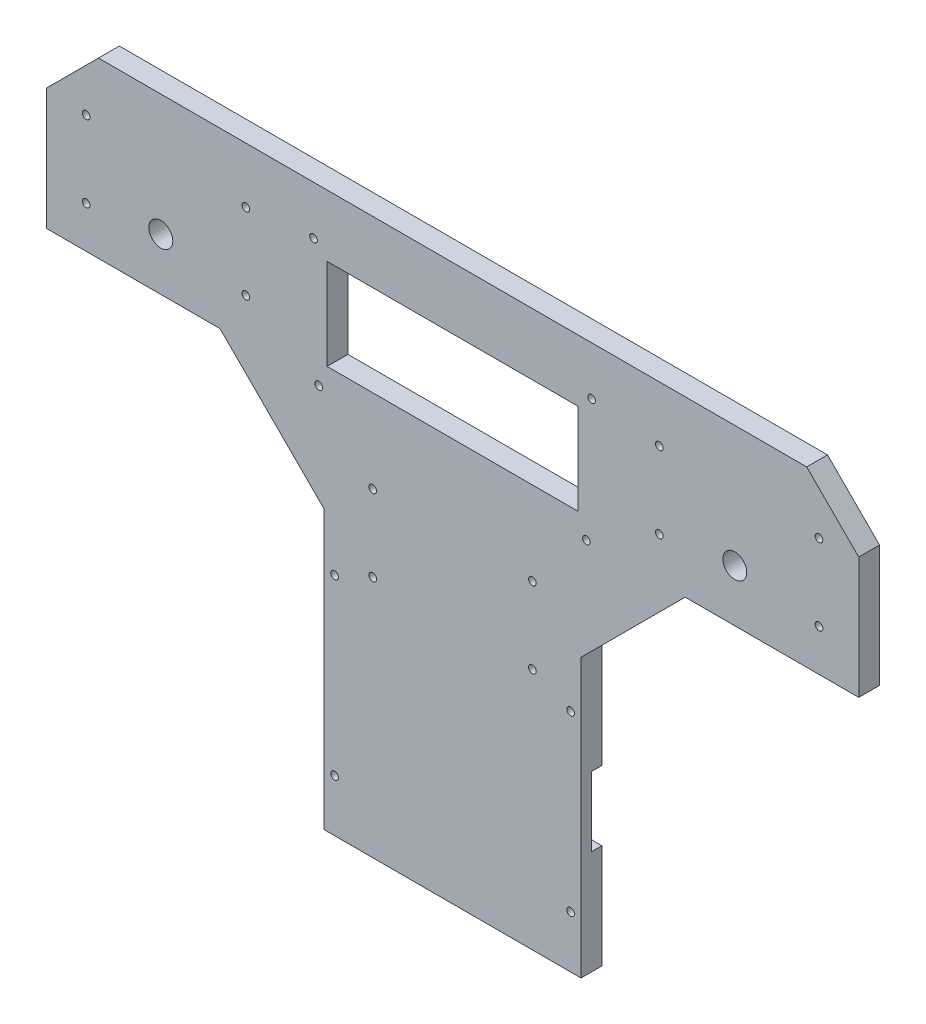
ISO-10303-21;
HEADER;
FILE_DESCRIPTION(('STEP AP214'),'2;1');
FILE_NAME('part.step','',(''),(''),'','','');
FILE_SCHEMA(('AUTOMOTIVE_DESIGN { 1 0 10303 214 1 1 1 1 }'));
ENDSEC;
DATA;
#1=APPLICATION_CONTEXT('core data for automotive mechanical design processes');
#2=APPLICATION_PROTOCOL_DEFINITION('international standard','automotive_design',2000,#1);
#3=PRODUCT_CONTEXT('',#1,'mechanical');
#4=PRODUCT('Part','Part','',(#3));
#5=PRODUCT_RELATED_PRODUCT_CATEGORY('part','',(#4));
#6=PRODUCT_DEFINITION_FORMATION('','',#4);
#7=PRODUCT_DEFINITION_CONTEXT('part definition',#1,'design');
#8=PRODUCT_DEFINITION('design','',#6,#7);
#9=PRODUCT_DEFINITION_SHAPE('','',#8);
#10=(LENGTH_UNIT() NAMED_UNIT(*) SI_UNIT(.MILLI.,.METRE.));
#11=(NAMED_UNIT(*) PLANE_ANGLE_UNIT() SI_UNIT($,.RADIAN.));
#12=(NAMED_UNIT(*) SI_UNIT($,.STERADIAN.) SOLID_ANGLE_UNIT());
#13=UNCERTAINTY_MEASURE_WITH_UNIT(LENGTH_MEASURE(1.E-05),#10,'distance_accuracy_value','');
#14=(GEOMETRIC_REPRESENTATION_CONTEXT(3) GLOBAL_UNCERTAINTY_ASSIGNED_CONTEXT((#13)) GLOBAL_UNIT_ASSIGNED_CONTEXT((#10,
#11,#12)) REPRESENTATION_CONTEXT('',''));
#15=CARTESIAN_POINT('',(0.,0.,0.));
#16=DIRECTION('',(0.,0.,1.));
#17=DIRECTION('',(1.,0.,0.));
#18=AXIS2_PLACEMENT_3D('',#15,#16,#17);
#19=CARTESIAN_POINT('',(0.,0.,6.));
#20=DIRECTION('',(0.,0.,1.));
#21=DIRECTION('',(1.,0.,0.));
#22=AXIS2_PLACEMENT_3D('',#19,#20,#21);
#23=PLANE('',#22);
#24=CARTESIAN_POINT('',(-22.5500000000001,122.,6.));
#25=DIRECTION('',(0.,0.,1.));
#26=DIRECTION('',(-1.,0.,0.));
#27=AXIS2_PLACEMENT_3D('',#24,#25,#26);
#28=CIRCLE('',#27,1.1);
#29=CARTESIAN_POINT('',(-23.6500000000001,122.,6.));
#30=VERTEX_POINT('',#29);
#31=EDGE_CURVE('E321',#30,#30,#28,.T.);
#32=ORIENTED_EDGE('',*,*,#31,.F.);
#33=EDGE_LOOP('',(#32));
#34=FACE_BOUND('',#33,.T.);
#35=CARTESIAN_POINT('',(-68.5499999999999,144.,6.));
#36=DIRECTION('',(0.,0.,1.));
#37=DIRECTION('',(-1.,0.,0.));
#38=AXIS2_PLACEMENT_3D('',#35,#36,#37);
#39=CIRCLE('',#38,1.10000000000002);
#40=CARTESIAN_POINT('',(-69.6499999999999,144.,6.));
#41=VERTEX_POINT('',#40);
#42=EDGE_CURVE('E333',#41,#41,#39,.T.);
#43=ORIENTED_EDGE('',*,*,#42,.F.);
#44=EDGE_LOOP('',(#43));
#45=FACE_BOUND('',#44,.T.);
#46=CARTESIAN_POINT('',(-47.0499999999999,125.,6.));
#47=DIRECTION('',(0.,0.,1.));
#48=DIRECTION('',(-1.,0.,0.));
#49=AXIS2_PLACEMENT_3D('',#46,#47,#48);
#50=CIRCLE('',#49,3.45000000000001);
#51=CARTESIAN_POINT('',(-50.4999999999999,125.,6.));
#52=VERTEX_POINT('',#51);
#53=EDGE_CURVE('E345',#52,#52,#50,.T.);
#54=ORIENTED_EDGE('',*,*,#53,.F.);
#55=EDGE_LOOP('',(#54));
#56=FACE_BOUND('',#55,.T.);
#57=CARTESIAN_POINT('',(2.99999999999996,65.,6.));
#58=DIRECTION('',(0.,0.,1.));
#59=DIRECTION('',(1.,0.,0.));
#60=AXIS2_PLACEMENT_3D('',#57,#58,#59);
#61=CIRCLE('',#60,1.10000000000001);
#62=CARTESIAN_POINT('',(4.09999999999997,65.,6.));
#63=VERTEX_POINT('',#62);
#64=EDGE_CURVE('E357',#63,#63,#61,.T.);
#65=ORIENTED_EDGE('',*,*,#64,.F.);
#66=EDGE_LOOP('',(#65));
#67=FACE_BOUND('',#66,.T.);
#68=CARTESIAN_POINT('',(71.,65.,6.));
#69=DIRECTION('',(0.,0.,1.));
#70=DIRECTION('',(-1.,0.,0.));
#71=AXIS2_PLACEMENT_3D('',#68,#69,#70);
#72=CIRCLE('',#71,1.10000000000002);
#73=CARTESIAN_POINT('',(69.9,65.,6.));
#74=VERTEX_POINT('',#73);
#75=EDGE_CURVE('E369',#74,#74,#72,.T.);
#76=ORIENTED_EDGE('',*,*,#75,.F.);
#77=EDGE_LOOP('',(#76));
#78=FACE_BOUND('',#77,.T.);
#79=CARTESIAN_POINT('',(60.,69.9999999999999,6.));
#80=DIRECTION('',(0.,0.,1.));
#81=DIRECTION('',(-1.,0.,0.));
#82=AXIS2_PLACEMENT_3D('',#79,#80,#81);
#83=CIRCLE('',#82,1.1);
#84=CARTESIAN_POINT('',(58.9,69.9999999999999,6.));
#85=VERTEX_POINT('',#84);
#86=EDGE_CURVE('E381',#85,#85,#83,.T.);
#87=ORIENTED_EDGE('',*,*,#86,.F.);
#88=EDGE_LOOP('',(#87));
#89=FACE_BOUND('',#88,.T.);
#90=CARTESIAN_POINT('',(14.,69.9999999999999,6.));
#91=DIRECTION('',(0.,0.,1.));
#92=DIRECTION('',(1.,0.,0.));
#93=AXIS2_PLACEMENT_3D('',#90,#91,#92);
#94=CIRCLE('',#93,1.1);
#95=CARTESIAN_POINT('',(15.1,69.9999999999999,6.));
#96=VERTEX_POINT('',#95);
#97=EDGE_CURVE('E393',#96,#96,#94,.T.);
#98=ORIENTED_EDGE('',*,*,#97,.F.);
#99=EDGE_LOOP('',(#98));
#100=FACE_BOUND('',#99,.T.);
#101=CARTESIAN_POINT('',(96.5500000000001,144.,6.));
#102=DIRECTION('',(0.,0.,1.));
#103=DIRECTION('',(-1.,0.,0.));
#104=AXIS2_PLACEMENT_3D('',#101,#102,#103);
#105=CIRCLE('',#104,1.1);
#106=CARTESIAN_POINT('',(95.45,144.,6.));
#107=VERTEX_POINT('',#106);
#108=EDGE_CURVE('E405',#107,#107,#105,.T.);
#109=ORIENTED_EDGE('',*,*,#108,.F.);
#110=EDGE_LOOP('',(#109));
#111=FACE_BOUND('',#110,.T.);
#112=CARTESIAN_POINT('',(142.55,122.,6.));
#113=DIRECTION('',(0.,0.,1.));
#114=DIRECTION('',(-1.,0.,0.));
#115=AXIS2_PLACEMENT_3D('',#112,#113,#114);
#116=CIRCLE('',#115,1.10000000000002);
#117=CARTESIAN_POINT('',(141.45,122.,6.));
#118=VERTEX_POINT('',#117);
#119=EDGE_CURVE('E417',#118,#118,#116,.T.);
#120=ORIENTED_EDGE('',*,*,#119,.F.);
#121=EDGE_LOOP('',(#120));
#122=FACE_BOUND('',#121,.T.);
#123=CARTESIAN_POINT('',(75.55,110.,6.));
#124=DIRECTION('',(0.,0.,1.));
#125=DIRECTION('',(-1.,0.,0.));
#126=AXIS2_PLACEMENT_3D('',#123,#124,#125);
#127=CIRCLE('',#126,1.10000000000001);
#128=CARTESIAN_POINT('',(74.45,110.,6.));
#129=VERTEX_POINT('',#128);
#130=EDGE_CURVE('E429',#129,#129,#127,.T.);
#131=ORIENTED_EDGE('',*,*,#130,.F.);
#132=EDGE_LOOP('',(#131));
#133=FACE_BOUND('',#132,.T.);
#134=CARTESIAN_POINT('',(-3.05000000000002,146.,6.));
#135=DIRECTION('',(0.,0.,1.));
#136=DIRECTION('',(1.,0.,0.));
#137=AXIS2_PLACEMENT_3D('',#134,#135,#136);
#138=CIRCLE('',#137,1.09999999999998);
#139=CARTESIAN_POINT('',(-1.95000000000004,146.,6.));
#140=VERTEX_POINT('',#139);
#141=EDGE_CURVE('E441',#140,#140,#138,.T.);
#142=ORIENTED_EDGE('',*,*,#141,.F.);
#143=EDGE_LOOP('',(#142));
#144=FACE_BOUND('',#143,.T.);
#145=DIRECTION('',(0.707106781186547,0.707106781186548,0.));
#146=VECTOR('',#145,1.);
#147=CARTESIAN_POINT('',(104.,110.,6.));
#148=LINE('',#147,#146);
#149=CARTESIAN_POINT('',(74.,79.9999999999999,6.));
#150=VERTEX_POINT('',#149);
#151=CARTESIAN_POINT('',(104.,110.,6.));
#152=VERTEX_POINT('',#151);
#153=EDGE_CURVE('E478',#150,#152,#148,.T.);
#154=ORIENTED_EDGE('',*,*,#153,.T.);
#155=DIRECTION('',(1.,0.,0.));
#156=VECTOR('',#155,1.);
#157=CARTESIAN_POINT('',(154.,110.,6.));
#158=LINE('',#157,#156);
#159=CARTESIAN_POINT('',(154.,110.,6.));
#160=VERTEX_POINT('',#159);
#161=EDGE_CURVE('E481',#152,#160,#158,.T.);
#162=ORIENTED_EDGE('',*,*,#161,.T.);
#163=DIRECTION('',(0.,1.,0.));
#164=VECTOR('',#163,1.);
#165=CARTESIAN_POINT('',(154.,110.,6.));
#166=LINE('',#165,#164);
#167=CARTESIAN_POINT('',(154.,145.,6.));
#168=VERTEX_POINT('',#167);
#169=EDGE_CURVE('E484',#160,#168,#166,.T.);
#170=ORIENTED_EDGE('',*,*,#169,.T.);
#171=DIRECTION('',(-0.707106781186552,0.707106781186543,0.));
#172=VECTOR('',#171,1.);
#173=CARTESIAN_POINT('',(154.,145.,6.));
#174=LINE('',#173,#172);
#175=CARTESIAN_POINT('',(139.,160.,6.));
#176=VERTEX_POINT('',#175);
#177=EDGE_CURVE('E486',#168,#176,#174,.T.);
#178=ORIENTED_EDGE('',*,*,#177,.T.);
#179=DIRECTION('',(-1.,0.,0.));
#180=VECTOR('',#179,1.);
#181=CARTESIAN_POINT('',(-65.0000000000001,160.,6.));
#182=LINE('',#181,#180);
#183=CARTESIAN_POINT('',(-65.0000000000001,160.,6.));
#184=VERTEX_POINT('',#183);
#185=EDGE_CURVE('E488',#176,#184,#182,.T.);
#186=ORIENTED_EDGE('',*,*,#185,.T.);
#187=DIRECTION('',(-0.707106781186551,-0.707106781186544,0.));
#188=VECTOR('',#187,1.);
#189=CARTESIAN_POINT('',(-80.,145.,6.));
#190=LINE('',#189,#188);
#191=CARTESIAN_POINT('',(-80.,145.,6.));
#192=VERTEX_POINT('',#191);
#193=EDGE_CURVE('E490',#184,#192,#190,.T.);
#194=ORIENTED_EDGE('',*,*,#193,.T.);
#195=DIRECTION('',(0.,-1.,0.));
#196=VECTOR('',#195,1.);
#197=CARTESIAN_POINT('',(-80.,110.,6.));
#198=LINE('',#197,#196);
#199=CARTESIAN_POINT('',(-80.,110.,6.));
#200=VERTEX_POINT('',#199);
#201=EDGE_CURVE('E492',#192,#200,#198,.T.);
#202=ORIENTED_EDGE('',*,*,#201,.T.);
#203=DIRECTION('',(1.,0.,0.));
#204=VECTOR('',#203,1.);
#205=CARTESIAN_POINT('',(-80.,110.,6.));
#206=LINE('',#205,#204);
#207=CARTESIAN_POINT('',(-30.0000000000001,110.,6.));
#208=VERTEX_POINT('',#207);
#209=EDGE_CURVE('E494',#200,#208,#206,.T.);
#210=ORIENTED_EDGE('',*,*,#209,.T.);
#211=DIRECTION('',(0.707106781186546,-0.707106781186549,0.));
#212=VECTOR('',#211,1.);
#213=CARTESIAN_POINT('',(-30.0000000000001,110.,6.));
#214=LINE('',#213,#212);
#215=CARTESIAN_POINT('',(0.,79.9999999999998,6.));
#216=VERTEX_POINT('',#215);
#217=EDGE_CURVE('E496',#208,#216,#214,.T.);
#218=ORIENTED_EDGE('',*,*,#217,.T.);
#219=DIRECTION('',(0.,-1.,0.));
#220=VECTOR('',#219,1.);
#221=CARTESIAN_POINT('',(0.,79.9999999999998,6.));
#222=LINE('',#221,#220);
#223=CARTESIAN_POINT('',(0.,0.,6.));
#224=VERTEX_POINT('',#223);
#225=EDGE_CURVE('E498',#216,#224,#222,.T.);
#226=ORIENTED_EDGE('',*,*,#225,.T.);
#227=DIRECTION('',(1.,0.,0.));
#228=VECTOR('',#227,1.);
#229=CARTESIAN_POINT('',(0.,0.,6.));
#230=LINE('',#229,#228);
#231=CARTESIAN_POINT('',(74.,0.,6.));
#232=VERTEX_POINT('',#231);
#233=EDGE_CURVE('E500',#224,#232,#230,.T.);
#234=ORIENTED_EDGE('',*,*,#233,.T.);
#235=DIRECTION('',(0.,1.,0.));
#236=VECTOR('',#235,1.);
#237=CARTESIAN_POINT('',(74.,79.9999999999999,6.));
#238=LINE('',#237,#236);
#239=EDGE_CURVE('E502',#232,#150,#238,.T.);
#240=ORIENTED_EDGE('',*,*,#239,.T.);
#241=EDGE_LOOP('',(#154,#162,#170,#178,#186,#194,#202,#210,#218,#226,#234,#240));
#242=FACE_BOUND('',#241,.T.);
#243=DIRECTION('',(-1.,0.,0.));
#244=VECTOR('',#243,1.);
#245=CARTESIAN_POINT('',(0.849999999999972,142.2,6.));
#246=LINE('',#245,#244);
#247=CARTESIAN_POINT('',(73.15,142.2,6.));
#248=VERTEX_POINT('',#247);
#249=CARTESIAN_POINT('',(0.849999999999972,142.2,6.));
#250=VERTEX_POINT('',#249);
#251=EDGE_CURVE('E449',#248,#250,#246,.T.);
#252=ORIENTED_EDGE('',*,*,#251,.F.);
#253=DIRECTION('',(0.,1.,0.));
#254=VECTOR('',#253,1.);
#255=CARTESIAN_POINT('',(73.15,142.2,6.));
#256=LINE('',#255,#254);
#257=CARTESIAN_POINT('',(73.15,116.,6.));
#258=VERTEX_POINT('',#257);
#259=EDGE_CURVE('E447',#258,#248,#256,.T.);
#260=ORIENTED_EDGE('',*,*,#259,.F.);
#261=DIRECTION('',(1.,0.,0.));
#262=VECTOR('',#261,1.);
#263=CARTESIAN_POINT('',(0.849999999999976,116.,6.));
#264=LINE('',#263,#262);
#265=CARTESIAN_POINT('',(0.849999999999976,116.,6.));
#266=VERTEX_POINT('',#265);
#267=EDGE_CURVE('E455',#266,#258,#264,.T.);
#268=ORIENTED_EDGE('',*,*,#267,.F.);
#269=DIRECTION('',(0.,-1.,0.));
#270=VECTOR('',#269,1.);
#271=CARTESIAN_POINT('',(0.849999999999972,142.2,6.));
#272=LINE('',#271,#270);
#273=EDGE_CURVE('E452',#250,#266,#272,.T.);
#274=ORIENTED_EDGE('',*,*,#273,.F.);
#275=EDGE_LOOP('',(#252,#260,#268,#274));
#276=FACE_BOUND('',#275,.T.);
#277=CARTESIAN_POINT('',(-1.55000000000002,110.,6.));
#278=DIRECTION('',(0.,0.,1.));
#279=DIRECTION('',(1.,0.,0.));
#280=AXIS2_PLACEMENT_3D('',#277,#278,#279);
#281=CIRCLE('',#280,1.09999999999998);
#282=CARTESIAN_POINT('',(-0.450000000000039,110.,6.));
#283=VERTEX_POINT('',#282);
#284=EDGE_CURVE('E435',#283,#283,#281,.T.);
#285=ORIENTED_EDGE('',*,*,#284,.F.);
#286=EDGE_LOOP('',(#285));
#287=FACE_BOUND('',#286,.T.);
#288=CARTESIAN_POINT('',(96.55,122.,6.));
#289=DIRECTION('',(0.,0.,1.));
#290=DIRECTION('',(1.,0.,0.));
#291=AXIS2_PLACEMENT_3D('',#288,#289,#290);
#292=CIRCLE('',#291,1.10000000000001);
#293=CARTESIAN_POINT('',(97.65,122.,6.));
#294=VERTEX_POINT('',#293);
#295=EDGE_CURVE('E423',#294,#294,#292,.T.);
#296=ORIENTED_EDGE('',*,*,#295,.F.);
#297=EDGE_LOOP('',(#296));
#298=FACE_BOUND('',#297,.T.);
#299=CARTESIAN_POINT('',(142.55,144.,6.));
#300=DIRECTION('',(0.,0.,1.));
#301=DIRECTION('',(1.,0.,0.));
#302=AXIS2_PLACEMENT_3D('',#299,#300,#301);
#303=CIRCLE('',#302,1.10000000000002);
#304=CARTESIAN_POINT('',(143.65,144.,6.));
#305=VERTEX_POINT('',#304);
#306=EDGE_CURVE('E411',#305,#305,#303,.T.);
#307=ORIENTED_EDGE('',*,*,#306,.F.);
#308=EDGE_LOOP('',(#307));
#309=FACE_BOUND('',#308,.T.);
#310=CARTESIAN_POINT('',(118.28,125.,6.));
#311=DIRECTION('',(0.,0.,1.));
#312=DIRECTION('',(1.,0.,0.));
#313=AXIS2_PLACEMENT_3D('',#310,#311,#312);
#314=CIRCLE('',#313,3.45);
#315=CARTESIAN_POINT('',(121.73,125.,6.));
#316=VERTEX_POINT('',#315);
#317=EDGE_CURVE('E399',#316,#316,#314,.T.);
#318=ORIENTED_EDGE('',*,*,#317,.F.);
#319=EDGE_LOOP('',(#318));
#320=FACE_BOUND('',#319,.T.);
#321=CARTESIAN_POINT('',(14.,91.9999999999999,6.));
#322=DIRECTION('',(0.,0.,1.));
#323=DIRECTION('',(-1.,0.,0.));
#324=AXIS2_PLACEMENT_3D('',#321,#322,#323);
#325=CIRCLE('',#324,1.1);
#326=CARTESIAN_POINT('',(12.9,91.9999999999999,6.));
#327=VERTEX_POINT('',#326);
#328=EDGE_CURVE('E387',#327,#327,#325,.T.);
#329=ORIENTED_EDGE('',*,*,#328,.F.);
#330=EDGE_LOOP('',(#329));
#331=FACE_BOUND('',#330,.T.);
#332=CARTESIAN_POINT('',(71.,15.,6.));
#333=DIRECTION('',(0.,0.,1.));
#334=DIRECTION('',(1.,0.,0.));
#335=AXIS2_PLACEMENT_3D('',#332,#333,#334);
#336=CIRCLE('',#335,1.10000000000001);
#337=CARTESIAN_POINT('',(72.1,15.,6.));
#338=VERTEX_POINT('',#337);
#339=EDGE_CURVE('E375',#338,#338,#336,.T.);
#340=ORIENTED_EDGE('',*,*,#339,.F.);
#341=EDGE_LOOP('',(#340));
#342=FACE_BOUND('',#341,.T.);
#343=CARTESIAN_POINT('',(2.99999999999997,15.,6.));
#344=DIRECTION('',(0.,0.,1.));
#345=DIRECTION('',(-1.,0.,0.));
#346=AXIS2_PLACEMENT_3D('',#343,#344,#345);
#347=CIRCLE('',#346,1.10000000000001);
#348=CARTESIAN_POINT('',(1.89999999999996,15.,6.));
#349=VERTEX_POINT('',#348);
#350=EDGE_CURVE('E363',#349,#349,#347,.T.);
#351=ORIENTED_EDGE('',*,*,#350,.F.);
#352=EDGE_LOOP('',(#351));
#353=FACE_BOUND('',#352,.T.);
#354=CARTESIAN_POINT('',(77.05,146.,6.));
#355=DIRECTION('',(0.,0.,1.));
#356=DIRECTION('',(-1.,0.,0.));
#357=AXIS2_PLACEMENT_3D('',#354,#355,#356);
#358=CIRCLE('',#357,1.09999999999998);
#359=CARTESIAN_POINT('',(75.95,146.,6.));
#360=VERTEX_POINT('',#359);
#361=EDGE_CURVE('E351',#360,#360,#358,.T.);
#362=ORIENTED_EDGE('',*,*,#361,.F.);
#363=EDGE_LOOP('',(#362));
#364=FACE_BOUND('',#363,.T.);
#365=CARTESIAN_POINT('',(-22.5500000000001,144.,6.));
#366=DIRECTION('',(0.,0.,1.));
#367=DIRECTION('',(1.,0.,0.));
#368=AXIS2_PLACEMENT_3D('',#365,#366,#367);
#369=CIRCLE('',#368,1.1);
#370=CARTESIAN_POINT('',(-21.4500000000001,144.,6.));
#371=VERTEX_POINT('',#370);
#372=EDGE_CURVE('E339',#371,#371,#369,.T.);
#373=ORIENTED_EDGE('',*,*,#372,.F.);
#374=EDGE_LOOP('',(#373));
#375=FACE_BOUND('',#374,.T.);
#376=CARTESIAN_POINT('',(-68.5499999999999,122.,6.));
#377=DIRECTION('',(0.,0.,1.));
#378=DIRECTION('',(1.,0.,0.));
#379=AXIS2_PLACEMENT_3D('',#376,#377,#378);
#380=CIRCLE('',#379,1.10000000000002);
#381=CARTESIAN_POINT('',(-67.4499999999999,122.,6.));
#382=VERTEX_POINT('',#381);
#383=EDGE_CURVE('E327',#382,#382,#380,.T.);
#384=ORIENTED_EDGE('',*,*,#383,.F.);
#385=EDGE_LOOP('',(#384));
#386=FACE_BOUND('',#385,.T.);
#387=CARTESIAN_POINT('',(60.,91.9999999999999,6.));
#388=DIRECTION('',(0.,0.,1.));
#389=DIRECTION('',(1.,0.,0.));
#390=AXIS2_PLACEMENT_3D('',#387,#388,#389);
#391=CIRCLE('',#390,1.10000000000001);
#392=CARTESIAN_POINT('',(61.1,91.9999999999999,6.));
#393=VERTEX_POINT('',#392);
#394=EDGE_CURVE('E315',#393,#393,#391,.T.);
#395=ORIENTED_EDGE('',*,*,#394,.F.);
#396=EDGE_LOOP('',(#395));
#397=FACE_BOUND('',#396,.T.);
#398=ADVANCED_FACE('F35',(#34,#45,#56,#67,#78,#89,#100,#111,#122,#133,#144,#242,#276,#287,#298,
#309,#320,#331,#342,#353,#364,#375,#386,#397),#23,.T.);
#399=CARTESIAN_POINT('',(0.,0.,0.));
#400=DIRECTION('',(0.,0.,1.));
#401=DIRECTION('',(1.,0.,0.));
#402=AXIS2_PLACEMENT_3D('',#399,#400,#401);
#403=PLANE('',#402);
#404=CARTESIAN_POINT('',(69.1313708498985,31.1313708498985,0.));
#405=DIRECTION('',(0.,0.,-1.));
#406=DIRECTION('',(1.,0.,0.));
#407=AXIS2_PLACEMENT_3D('',#404,#405,#406);
#408=CIRCLE('',#407,1.60000000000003);
#409=CARTESIAN_POINT('',(70.2627416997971,30.,0.));
#410=VERTEX_POINT('',#409);
#411=CARTESIAN_POINT('',(68.0000000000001,32.262741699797,0.));
#412=VERTEX_POINT('',#411);
#413=EDGE_CURVE('E246',#410,#412,#408,.T.);
#414=ORIENTED_EDGE('',*,*,#413,.F.);
#415=DIRECTION('',(-1.,0.,0.));
#416=VECTOR('',#415,1.);
#417=CARTESIAN_POINT('',(70.2627416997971,30.,0.));
#418=LINE('',#417,#416);
#419=CARTESIAN_POINT('',(74.0000000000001,30.,0.));
#420=VERTEX_POINT('',#419);
#421=EDGE_CURVE('E259',#420,#410,#418,.T.);
#422=ORIENTED_EDGE('',*,*,#421,.F.);
#423=DIRECTION('',(0.,1.,0.));
#424=VECTOR('',#423,1.);
#425=CARTESIAN_POINT('',(74.,79.9999999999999,0.));
#426=LINE('',#425,#424);
#427=CARTESIAN_POINT('',(74.,0.,0.));
#428=VERTEX_POINT('',#427);
#429=EDGE_CURVE('E482',#428,#420,#426,.T.);
#430=ORIENTED_EDGE('',*,*,#429,.F.);
#431=DIRECTION('',(1.,0.,0.));
#432=VECTOR('',#431,1.);
#433=CARTESIAN_POINT('',(0.,0.,0.));
#434=LINE('',#433,#432);
#435=CARTESIAN_POINT('',(0.,0.,0.));
#436=VERTEX_POINT('',#435);
#437=EDGE_CURVE('E527',#436,#428,#434,.T.);
#438=ORIENTED_EDGE('',*,*,#437,.F.);
#439=DIRECTION('',(0.,-1.,0.));
#440=VECTOR('',#439,1.);
#441=CARTESIAN_POINT('',(0.,79.9999999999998,0.));
#442=LINE('',#441,#440);
#443=CARTESIAN_POINT('',(0.,30.,0.));
#444=VERTEX_POINT('',#443);
#445=EDGE_CURVE('E523',#444,#436,#442,.T.);
#446=ORIENTED_EDGE('',*,*,#445,.F.);
#447=DIRECTION('',(-1.,0.,0.));
#448=VECTOR('',#447,1.);
#449=CARTESIAN_POINT('',(3.73725830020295,30.,0.));
#450=LINE('',#449,#448);
#451=CARTESIAN_POINT('',(3.73725830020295,30.,0.));
#452=VERTEX_POINT('',#451);
#453=EDGE_CURVE('E292',#452,#444,#450,.T.);
#454=ORIENTED_EDGE('',*,*,#453,.F.);
#455=CARTESIAN_POINT('',(4.86862915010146,31.1313708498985,0.));
#456=DIRECTION('',(0.,0.,-1.));
#457=DIRECTION('',(-1.,0.,0.));
#458=AXIS2_PLACEMENT_3D('',#455,#456,#457);
#459=CIRCLE('',#458,1.60000000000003);
#460=CARTESIAN_POINT('',(5.99999999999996,32.262741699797,0.));
#461=VERTEX_POINT('',#460);
#462=EDGE_CURVE('E266',#461,#452,#459,.T.);
#463=ORIENTED_EDGE('',*,*,#462,.F.);
#464=DIRECTION('',(0.,-1.,0.));
#465=VECTOR('',#464,1.);
#466=CARTESIAN_POINT('',(5.99999999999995,47.737258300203,0.));
#467=LINE('',#466,#465);
#468=CARTESIAN_POINT('',(5.99999999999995,47.737258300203,0.));
#469=VERTEX_POINT('',#468);
#470=EDGE_CURVE('E276',#469,#461,#467,.T.);
#471=ORIENTED_EDGE('',*,*,#470,.F.);
#472=CARTESIAN_POINT('',(4.86862915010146,48.8686291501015,0.));
#473=DIRECTION('',(0.,0.,-1.));
#474=DIRECTION('',(1.,0.,0.));
#475=AXIS2_PLACEMENT_3D('',#472,#473,#474);
#476=CIRCLE('',#475,1.60000000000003);
#477=CARTESIAN_POINT('',(3.73725830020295,50.,0.));
#478=VERTEX_POINT('',#477);
#479=EDGE_CURVE('E297',#478,#469,#476,.T.);
#480=ORIENTED_EDGE('',*,*,#479,.F.);
#481=DIRECTION('',(1.,0.,0.));
#482=VECTOR('',#481,1.);
#483=CARTESIAN_POINT('',(3.73725830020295,50.,0.));
#484=LINE('',#483,#482);
#485=CARTESIAN_POINT('',(0.,50.,0.));
#486=VERTEX_POINT('',#485);
#487=EDGE_CURVE('E294',#486,#478,#484,.T.);
#488=ORIENTED_EDGE('',*,*,#487,.F.);
#489=CARTESIAN_POINT('',(0.,79.9999999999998,0.));
#490=VERTEX_POINT('',#489);
#491=EDGE_CURVE('E524',#490,#486,#442,.T.);
#492=ORIENTED_EDGE('',*,*,#491,.F.);
#493=DIRECTION('',(0.707106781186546,-0.707106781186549,0.));
#494=VECTOR('',#493,1.);
#495=CARTESIAN_POINT('',(-30.0000000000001,110.,0.));
#496=LINE('',#495,#494);
#497=CARTESIAN_POINT('',(-30.0000000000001,110.,0.));
#498=VERTEX_POINT('',#497);
#499=EDGE_CURVE('E521',#498,#490,#496,.T.);
#500=ORIENTED_EDGE('',*,*,#499,.F.);
#501=DIRECTION('',(1.,0.,0.));
#502=VECTOR('',#501,1.);
#503=CARTESIAN_POINT('',(-80.,110.,0.));
#504=LINE('',#503,#502);
#505=CARTESIAN_POINT('',(-80.,110.,0.));
#506=VERTEX_POINT('',#505);
#507=EDGE_CURVE('E519',#506,#498,#504,.T.);
#508=ORIENTED_EDGE('',*,*,#507,.F.);
#509=DIRECTION('',(0.,-1.,0.));
#510=VECTOR('',#509,1.);
#511=CARTESIAN_POINT('',(-80.,110.,0.));
#512=LINE('',#511,#510);
#513=CARTESIAN_POINT('',(-80.,145.,0.));
#514=VERTEX_POINT('',#513);
#515=EDGE_CURVE('E517',#514,#506,#512,.T.);
#516=ORIENTED_EDGE('',*,*,#515,.F.);
#517=DIRECTION('',(-0.707106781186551,-0.707106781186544,0.));
#518=VECTOR('',#517,1.);
#519=CARTESIAN_POINT('',(-80.,145.,0.));
#520=LINE('',#519,#518);
#521=CARTESIAN_POINT('',(-65.0000000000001,160.,0.));
#522=VERTEX_POINT('',#521);
#523=EDGE_CURVE('E515',#522,#514,#520,.T.);
#524=ORIENTED_EDGE('',*,*,#523,.F.);
#525=DIRECTION('',(-1.,0.,0.));
#526=VECTOR('',#525,1.);
#527=CARTESIAN_POINT('',(-65.0000000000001,160.,0.));
#528=LINE('',#527,#526);
#529=CARTESIAN_POINT('',(139.,160.,0.));
#530=VERTEX_POINT('',#529);
#531=EDGE_CURVE('E513',#530,#522,#528,.T.);
#532=ORIENTED_EDGE('',*,*,#531,.F.);
#533=DIRECTION('',(-0.707106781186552,0.707106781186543,0.));
#534=VECTOR('',#533,1.);
#535=CARTESIAN_POINT('',(154.,145.,0.));
#536=LINE('',#535,#534);
#537=CARTESIAN_POINT('',(154.,145.,0.));
#538=VERTEX_POINT('',#537);
#539=EDGE_CURVE('E511',#538,#530,#536,.T.);
#540=ORIENTED_EDGE('',*,*,#539,.F.);
#541=DIRECTION('',(0.,1.,0.));
#542=VECTOR('',#541,1.);
#543=CARTESIAN_POINT('',(154.,110.,0.));
#544=LINE('',#543,#542);
#545=CARTESIAN_POINT('',(154.,110.,0.));
#546=VERTEX_POINT('',#545);
#547=EDGE_CURVE('E509',#546,#538,#544,.T.);
#548=ORIENTED_EDGE('',*,*,#547,.F.);
#549=DIRECTION('',(1.,0.,0.));
#550=VECTOR('',#549,1.);
#551=CARTESIAN_POINT('',(154.,110.,0.));
#552=LINE('',#551,#550);
#553=CARTESIAN_POINT('',(104.,110.,0.));
#554=VERTEX_POINT('',#553);
#555=EDGE_CURVE('E507',#554,#546,#552,.T.);
#556=ORIENTED_EDGE('',*,*,#555,.F.);
#557=DIRECTION('',(0.707106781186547,0.707106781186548,0.));
#558=VECTOR('',#557,1.);
#559=CARTESIAN_POINT('',(104.,110.,0.));
#560=LINE('',#559,#558);
#561=CARTESIAN_POINT('',(74.,79.9999999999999,0.));
#562=VERTEX_POINT('',#561);
#563=EDGE_CURVE('E477',#562,#554,#560,.T.);
#564=ORIENTED_EDGE('',*,*,#563,.F.);
#565=CARTESIAN_POINT('',(74.0000000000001,50.,0.));
#566=VERTEX_POINT('',#565);
#567=EDGE_CURVE('E529',#566,#562,#426,.T.);
#568=ORIENTED_EDGE('',*,*,#567,.F.);
#569=DIRECTION('',(1.,0.,0.));
#570=VECTOR('',#569,1.);
#571=CARTESIAN_POINT('',(70.2627416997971,50.,0.));
#572=LINE('',#571,#570);
#573=CARTESIAN_POINT('',(70.2627416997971,50.,0.));
#574=VERTEX_POINT('',#573);
#575=EDGE_CURVE('E257',#574,#566,#572,.T.);
#576=ORIENTED_EDGE('',*,*,#575,.F.);
#577=CARTESIAN_POINT('',(69.1313708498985,48.8686291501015,0.));
#578=DIRECTION('',(0.,0.,-1.));
#579=DIRECTION('',(-1.,0.,0.));
#580=AXIS2_PLACEMENT_3D('',#577,#578,#579);
#581=CIRCLE('',#580,1.60000000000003);
#582=CARTESIAN_POINT('',(68.0000000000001,47.737258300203,0.));
#583=VERTEX_POINT('',#582);
#584=EDGE_CURVE('E229',#583,#574,#581,.T.);
#585=ORIENTED_EDGE('',*,*,#584,.F.);
#586=DIRECTION('',(0.,1.,0.));
#587=VECTOR('',#586,1.);
#588=CARTESIAN_POINT('',(68.0000000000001,47.737258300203,0.));
#589=LINE('',#588,#587);
#590=EDGE_CURVE('E243',#412,#583,#589,.T.);
#591=ORIENTED_EDGE('',*,*,#590,.F.);
#592=EDGE_LOOP('',(#414,#422,#430,#438,#446,#454,#463,#471,#480,#488,#492,#500,#508,#516,#524,
#532,#540,#548,#556,#564,#568,#576,#585,#591));
#593=FACE_BOUND('',#592,.T.);
#594=DIRECTION('',(0.,1.,0.));
#595=VECTOR('',#594,1.);
#596=CARTESIAN_POINT('',(73.15,142.2,0.));
#597=LINE('',#596,#595);
#598=CARTESIAN_POINT('',(73.15,116.,0.));
#599=VERTEX_POINT('',#598);
#600=CARTESIAN_POINT('',(73.15,142.2,0.));
#601=VERTEX_POINT('',#600);
#602=EDGE_CURVE('E444',#599,#601,#597,.T.);
#603=ORIENTED_EDGE('',*,*,#602,.T.);
#604=DIRECTION('',(-1.,0.,0.));
#605=VECTOR('',#604,1.);
#606=CARTESIAN_POINT('',(0.849999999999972,142.2,0.));
#607=LINE('',#606,#605);
#608=CARTESIAN_POINT('',(0.849999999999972,142.2,0.));
#609=VERTEX_POINT('',#608);
#610=EDGE_CURVE('E460',#601,#609,#607,.T.);
#611=ORIENTED_EDGE('',*,*,#610,.T.);
#612=DIRECTION('',(0.,-1.,0.));
#613=VECTOR('',#612,1.);
#614=CARTESIAN_POINT('',(0.849999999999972,142.2,0.));
#615=LINE('',#614,#613);
#616=CARTESIAN_POINT('',(0.849999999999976,116.,0.));
#617=VERTEX_POINT('',#616);
#618=EDGE_CURVE('E463',#609,#617,#615,.T.);
#619=ORIENTED_EDGE('',*,*,#618,.T.);
#620=DIRECTION('',(1.,0.,0.));
#621=VECTOR('',#620,1.);
#622=CARTESIAN_POINT('',(0.849999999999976,116.,0.));
#623=LINE('',#622,#621);
#624=EDGE_CURVE('E450',#617,#599,#623,.T.);
#625=ORIENTED_EDGE('',*,*,#624,.T.);
#626=EDGE_LOOP('',(#603,#611,#619,#625));
#627=FACE_BOUND('',#626,.T.);
#628=CARTESIAN_POINT('',(-3.05000000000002,146.,0.));
#629=DIRECTION('',(0.,0.,1.));
#630=DIRECTION('',(1.,0.,0.));
#631=AXIS2_PLACEMENT_3D('',#628,#629,#630);
#632=CIRCLE('',#631,1.09999999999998);
#633=CARTESIAN_POINT('',(-1.95000000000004,146.,0.));
#634=VERTEX_POINT('',#633);
#635=EDGE_CURVE('E438',#634,#634,#632,.T.);
#636=ORIENTED_EDGE('',*,*,#635,.T.);
#637=EDGE_LOOP('',(#636));
#638=FACE_BOUND('',#637,.T.);
#639=CARTESIAN_POINT('',(-1.55000000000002,110.,0.));
#640=DIRECTION('',(0.,0.,1.));
#641=DIRECTION('',(1.,0.,0.));
#642=AXIS2_PLACEMENT_3D('',#639,#640,#641);
#643=CIRCLE('',#642,1.09999999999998);
#644=CARTESIAN_POINT('',(-0.450000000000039,110.,0.));
#645=VERTEX_POINT('',#644);
#646=EDGE_CURVE('E432',#645,#645,#643,.T.);
#647=ORIENTED_EDGE('',*,*,#646,.T.);
#648=EDGE_LOOP('',(#647));
#649=FACE_BOUND('',#648,.T.);
#650=CARTESIAN_POINT('',(75.55,110.,0.));
#651=DIRECTION('',(0.,0.,1.));
#652=DIRECTION('',(-1.,0.,0.));
#653=AXIS2_PLACEMENT_3D('',#650,#651,#652);
#654=CIRCLE('',#653,1.10000000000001);
#655=CARTESIAN_POINT('',(74.45,110.,0.));
#656=VERTEX_POINT('',#655);
#657=EDGE_CURVE('E426',#656,#656,#654,.T.);
#658=ORIENTED_EDGE('',*,*,#657,.T.);
#659=EDGE_LOOP('',(#658));
#660=FACE_BOUND('',#659,.T.);
#661=CARTESIAN_POINT('',(96.55,122.,0.));
#662=DIRECTION('',(0.,0.,1.));
#663=DIRECTION('',(1.,0.,0.));
#664=AXIS2_PLACEMENT_3D('',#661,#662,#663);
#665=CIRCLE('',#664,1.10000000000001);
#666=CARTESIAN_POINT('',(97.65,122.,0.));
#667=VERTEX_POINT('',#666);
#668=EDGE_CURVE('E420',#667,#667,#665,.T.);
#669=ORIENTED_EDGE('',*,*,#668,.T.);
#670=EDGE_LOOP('',(#669));
#671=FACE_BOUND('',#670,.T.);
#672=CARTESIAN_POINT('',(142.55,122.,0.));
#673=DIRECTION('',(0.,0.,1.));
#674=DIRECTION('',(-1.,0.,0.));
#675=AXIS2_PLACEMENT_3D('',#672,#673,#674);
#676=CIRCLE('',#675,1.10000000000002);
#677=CARTESIAN_POINT('',(141.45,122.,0.));
#678=VERTEX_POINT('',#677);
#679=EDGE_CURVE('E414',#678,#678,#676,.T.);
#680=ORIENTED_EDGE('',*,*,#679,.T.);
#681=EDGE_LOOP('',(#680));
#682=FACE_BOUND('',#681,.T.);
#683=CARTESIAN_POINT('',(142.55,144.,0.));
#684=DIRECTION('',(0.,0.,1.));
#685=DIRECTION('',(1.,0.,0.));
#686=AXIS2_PLACEMENT_3D('',#683,#684,#685);
#687=CIRCLE('',#686,1.10000000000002);
#688=CARTESIAN_POINT('',(143.65,144.,0.));
#689=VERTEX_POINT('',#688);
#690=EDGE_CURVE('E408',#689,#689,#687,.T.);
#691=ORIENTED_EDGE('',*,*,#690,.T.);
#692=EDGE_LOOP('',(#691));
#693=FACE_BOUND('',#692,.T.);
#694=CARTESIAN_POINT('',(96.5500000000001,144.,0.));
#695=DIRECTION('',(0.,0.,1.));
#696=DIRECTION('',(-1.,0.,0.));
#697=AXIS2_PLACEMENT_3D('',#694,#695,#696);
#698=CIRCLE('',#697,1.1);
#699=CARTESIAN_POINT('',(95.45,144.,0.));
#700=VERTEX_POINT('',#699);
#701=EDGE_CURVE('E402',#700,#700,#698,.T.);
#702=ORIENTED_EDGE('',*,*,#701,.T.);
#703=EDGE_LOOP('',(#702));
#704=FACE_BOUND('',#703,.T.);
#705=CARTESIAN_POINT('',(118.28,125.,0.));
#706=DIRECTION('',(0.,0.,1.));
#707=DIRECTION('',(1.,0.,0.));
#708=AXIS2_PLACEMENT_3D('',#705,#706,#707);
#709=CIRCLE('',#708,3.45);
#710=CARTESIAN_POINT('',(121.73,125.,0.));
#711=VERTEX_POINT('',#710);
#712=EDGE_CURVE('E396',#711,#711,#709,.T.);
#713=ORIENTED_EDGE('',*,*,#712,.T.);
#714=EDGE_LOOP('',(#713));
#715=FACE_BOUND('',#714,.T.);
#716=CARTESIAN_POINT('',(14.,69.9999999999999,0.));
#717=DIRECTION('',(0.,0.,1.));
#718=DIRECTION('',(1.,0.,0.));
#719=AXIS2_PLACEMENT_3D('',#716,#717,#718);
#720=CIRCLE('',#719,1.1);
#721=CARTESIAN_POINT('',(15.1,69.9999999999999,0.));
#722=VERTEX_POINT('',#721);
#723=EDGE_CURVE('E390',#722,#722,#720,.T.);
#724=ORIENTED_EDGE('',*,*,#723,.T.);
#725=EDGE_LOOP('',(#724));
#726=FACE_BOUND('',#725,.T.);
#727=CARTESIAN_POINT('',(14.,91.9999999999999,0.));
#728=DIRECTION('',(0.,0.,1.));
#729=DIRECTION('',(-1.,0.,0.));
#730=AXIS2_PLACEMENT_3D('',#727,#728,#729);
#731=CIRCLE('',#730,1.1);
#732=CARTESIAN_POINT('',(12.9,91.9999999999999,0.));
#733=VERTEX_POINT('',#732);
#734=EDGE_CURVE('E384',#733,#733,#731,.T.);
#735=ORIENTED_EDGE('',*,*,#734,.T.);
#736=EDGE_LOOP('',(#735));
#737=FACE_BOUND('',#736,.T.);
#738=CARTESIAN_POINT('',(60.,69.9999999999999,0.));
#739=DIRECTION('',(0.,0.,1.));
#740=DIRECTION('',(-1.,0.,0.));
#741=AXIS2_PLACEMENT_3D('',#738,#739,#740);
#742=CIRCLE('',#741,1.1);
#743=CARTESIAN_POINT('',(58.9,69.9999999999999,0.));
#744=VERTEX_POINT('',#743);
#745=EDGE_CURVE('E378',#744,#744,#742,.T.);
#746=ORIENTED_EDGE('',*,*,#745,.T.);
#747=EDGE_LOOP('',(#746));
#748=FACE_BOUND('',#747,.T.);
#749=CARTESIAN_POINT('',(71.,15.,0.));
#750=DIRECTION('',(0.,0.,1.));
#751=DIRECTION('',(1.,0.,0.));
#752=AXIS2_PLACEMENT_3D('',#749,#750,#751);
#753=CIRCLE('',#752,1.10000000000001);
#754=CARTESIAN_POINT('',(72.1,15.,0.));
#755=VERTEX_POINT('',#754);
#756=EDGE_CURVE('E372',#755,#755,#753,.T.);
#757=ORIENTED_EDGE('',*,*,#756,.T.);
#758=EDGE_LOOP('',(#757));
#759=FACE_BOUND('',#758,.T.);
#760=CARTESIAN_POINT('',(71.,65.,0.));
#761=DIRECTION('',(0.,0.,1.));
#762=DIRECTION('',(-1.,0.,0.));
#763=AXIS2_PLACEMENT_3D('',#760,#761,#762);
#764=CIRCLE('',#763,1.10000000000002);
#765=CARTESIAN_POINT('',(69.9,65.,0.));
#766=VERTEX_POINT('',#765);
#767=EDGE_CURVE('E366',#766,#766,#764,.T.);
#768=ORIENTED_EDGE('',*,*,#767,.T.);
#769=EDGE_LOOP('',(#768));
#770=FACE_BOUND('',#769,.T.);
#771=CARTESIAN_POINT('',(2.99999999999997,15.,0.));
#772=DIRECTION('',(0.,0.,1.));
#773=DIRECTION('',(-1.,0.,0.));
#774=AXIS2_PLACEMENT_3D('',#771,#772,#773);
#775=CIRCLE('',#774,1.10000000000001);
#776=CARTESIAN_POINT('',(1.89999999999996,15.,0.));
#777=VERTEX_POINT('',#776);
#778=EDGE_CURVE('E360',#777,#777,#775,.T.);
#779=ORIENTED_EDGE('',*,*,#778,.T.);
#780=EDGE_LOOP('',(#779));
#781=FACE_BOUND('',#780,.T.);
#782=CARTESIAN_POINT('',(2.99999999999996,65.,0.));
#783=DIRECTION('',(0.,0.,1.));
#784=DIRECTION('',(1.,0.,0.));
#785=AXIS2_PLACEMENT_3D('',#782,#783,#784);
#786=CIRCLE('',#785,1.10000000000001);
#787=CARTESIAN_POINT('',(4.09999999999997,65.,0.));
#788=VERTEX_POINT('',#787);
#789=EDGE_CURVE('E354',#788,#788,#786,.T.);
#790=ORIENTED_EDGE('',*,*,#789,.T.);
#791=EDGE_LOOP('',(#790));
#792=FACE_BOUND('',#791,.T.);
#793=CARTESIAN_POINT('',(77.05,146.,0.));
#794=DIRECTION('',(0.,0.,1.));
#795=DIRECTION('',(-1.,0.,0.));
#796=AXIS2_PLACEMENT_3D('',#793,#794,#795);
#797=CIRCLE('',#796,1.09999999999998);
#798=CARTESIAN_POINT('',(75.95,146.,0.));
#799=VERTEX_POINT('',#798);
#800=EDGE_CURVE('E348',#799,#799,#797,.T.);
#801=ORIENTED_EDGE('',*,*,#800,.T.);
#802=EDGE_LOOP('',(#801));
#803=FACE_BOUND('',#802,.T.);
#804=CARTESIAN_POINT('',(-47.0499999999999,125.,0.));
#805=DIRECTION('',(0.,0.,1.));
#806=DIRECTION('',(-1.,0.,0.));
#807=AXIS2_PLACEMENT_3D('',#804,#805,#806);
#808=CIRCLE('',#807,3.45000000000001);
#809=CARTESIAN_POINT('',(-50.4999999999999,125.,0.));
#810=VERTEX_POINT('',#809);
#811=EDGE_CURVE('E342',#810,#810,#808,.T.);
#812=ORIENTED_EDGE('',*,*,#811,.T.);
#813=EDGE_LOOP('',(#812));
#814=FACE_BOUND('',#813,.T.);
#815=CARTESIAN_POINT('',(-22.5500000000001,144.,0.));
#816=DIRECTION('',(0.,0.,1.));
#817=DIRECTION('',(1.,0.,0.));
#818=AXIS2_PLACEMENT_3D('',#815,#816,#817);
#819=CIRCLE('',#818,1.1);
#820=CARTESIAN_POINT('',(-21.4500000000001,144.,0.));
#821=VERTEX_POINT('',#820);
#822=EDGE_CURVE('E336',#821,#821,#819,.T.);
#823=ORIENTED_EDGE('',*,*,#822,.T.);
#824=EDGE_LOOP('',(#823));
#825=FACE_BOUND('',#824,.T.);
#826=CARTESIAN_POINT('',(-68.5499999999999,144.,0.));
#827=DIRECTION('',(0.,0.,1.));
#828=DIRECTION('',(-1.,0.,0.));
#829=AXIS2_PLACEMENT_3D('',#826,#827,#828);
#830=CIRCLE('',#829,1.10000000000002);
#831=CARTESIAN_POINT('',(-69.6499999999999,144.,0.));
#832=VERTEX_POINT('',#831);
#833=EDGE_CURVE('E330',#832,#832,#830,.T.);
#834=ORIENTED_EDGE('',*,*,#833,.T.);
#835=EDGE_LOOP('',(#834));
#836=FACE_BOUND('',#835,.T.);
#837=CARTESIAN_POINT('',(-68.5499999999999,122.,0.));
#838=DIRECTION('',(0.,0.,1.));
#839=DIRECTION('',(1.,0.,0.));
#840=AXIS2_PLACEMENT_3D('',#837,#838,#839);
#841=CIRCLE('',#840,1.10000000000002);
#842=CARTESIAN_POINT('',(-67.4499999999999,122.,0.));
#843=VERTEX_POINT('',#842);
#844=EDGE_CURVE('E324',#843,#843,#841,.T.);
#845=ORIENTED_EDGE('',*,*,#844,.T.);
#846=EDGE_LOOP('',(#845));
#847=FACE_BOUND('',#846,.T.);
#848=CARTESIAN_POINT('',(-22.5500000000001,122.,0.));
#849=DIRECTION('',(0.,0.,1.));
#850=DIRECTION('',(-1.,0.,0.));
#851=AXIS2_PLACEMENT_3D('',#848,#849,#850);
#852=CIRCLE('',#851,1.1);
#853=CARTESIAN_POINT('',(-23.6500000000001,122.,0.));
#854=VERTEX_POINT('',#853);
#855=EDGE_CURVE('E318',#854,#854,#852,.T.);
#856=ORIENTED_EDGE('',*,*,#855,.T.);
#857=EDGE_LOOP('',(#856));
#858=FACE_BOUND('',#857,.T.);
#859=CARTESIAN_POINT('',(60.,91.9999999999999,0.));
#860=DIRECTION('',(0.,0.,1.));
#861=DIRECTION('',(1.,0.,0.));
#862=AXIS2_PLACEMENT_3D('',#859,#860,#861);
#863=CIRCLE('',#862,1.10000000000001);
#864=CARTESIAN_POINT('',(61.1,91.9999999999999,0.));
#865=VERTEX_POINT('',#864);
#866=EDGE_CURVE('E304',#865,#865,#863,.T.);
#867=ORIENTED_EDGE('',*,*,#866,.T.);
#868=EDGE_LOOP('',(#867));
#869=FACE_BOUND('',#868,.T.);
#870=ADVANCED_FACE('F571',(#593,#627,#638,#649,#660,#671,#682,#693,#704,#715,#726,#737,#748,
#759,#770,#781,#792,#803,#814,#825,#836,#847,#858,#869),#403,.F.);
#871=CARTESIAN_POINT('',(104.,110.,6.));
#872=DIRECTION('',(-0.707106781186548,0.707106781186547,0.));
#873=DIRECTION('',(-0.707106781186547,-0.707106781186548,0.));
#874=AXIS2_PLACEMENT_3D('',#871,#872,#873);
#875=PLANE('',#874);
#876=ORIENTED_EDGE('',*,*,#563,.T.);
#877=DIRECTION('',(0.,0.,-1.));
#878=VECTOR('',#877,1.);
#879=CARTESIAN_POINT('',(104.,110.,6.));
#880=LINE('',#879,#878);
#881=EDGE_CURVE('E11',#152,#554,#880,.T.);
#882=ORIENTED_EDGE('',*,*,#881,.F.);
#883=ORIENTED_EDGE('',*,*,#153,.F.);
#884=DIRECTION('',(0.,0.,-1.));
#885=VECTOR('',#884,1.);
#886=CARTESIAN_POINT('',(74.,79.9999999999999,6.));
#887=LINE('',#886,#885);
#888=EDGE_CURVE('E504',#150,#562,#887,.T.);
#889=ORIENTED_EDGE('',*,*,#888,.T.);
#890=EDGE_LOOP('',(#876,#882,#883,#889));
#891=FACE_BOUND('',#890,.T.);
#892=ADVANCED_FACE('F37',(#891),#875,.F.);
#893=CARTESIAN_POINT('',(154.,110.,6.));
#894=DIRECTION('',(0.,1.,0.));
#895=DIRECTION('',(-1.,0.,0.));
#896=AXIS2_PLACEMENT_3D('',#893,#894,#895);
#897=PLANE('',#896);
#898=ORIENTED_EDGE('',*,*,#555,.T.);
#899=DIRECTION('',(0.,0.,-1.));
#900=VECTOR('',#899,1.);
#901=CARTESIAN_POINT('',(154.,110.,6.));
#902=LINE('',#901,#900);
#903=EDGE_CURVE('E43',#160,#546,#902,.T.);
#904=ORIENTED_EDGE('',*,*,#903,.F.);
#905=ORIENTED_EDGE('',*,*,#161,.F.);
#906=ORIENTED_EDGE('',*,*,#881,.T.);
#907=EDGE_LOOP('',(#898,#904,#905,#906));
#908=FACE_BOUND('',#907,.T.);
#909=ADVANCED_FACE('F590',(#908),#897,.F.);
#910=CARTESIAN_POINT('',(154.,110.,6.));
#911=DIRECTION('',(-1.,0.,0.));
#912=DIRECTION('',(0.,0.,1.));
#913=AXIS2_PLACEMENT_3D('',#910,#911,#912);
#914=PLANE('',#913);
#915=ORIENTED_EDGE('',*,*,#547,.T.);
#916=DIRECTION('',(0.,0.,-1.));
#917=VECTOR('',#916,1.);
#918=CARTESIAN_POINT('',(154.,145.,6.));
#919=LINE('',#918,#917);
#920=EDGE_CURVE('E558',#168,#538,#919,.T.);
#921=ORIENTED_EDGE('',*,*,#920,.F.);
#922=ORIENTED_EDGE('',*,*,#169,.F.);
#923=ORIENTED_EDGE('',*,*,#903,.T.);
#924=EDGE_LOOP('',(#915,#921,#922,#923));
#925=FACE_BOUND('',#924,.T.);
#926=ADVANCED_FACE('F565',(#925),#914,.F.);
#927=CARTESIAN_POINT('',(154.,145.,6.));
#928=DIRECTION('',(-0.707106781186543,-0.707106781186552,0.));
#929=DIRECTION('',(0.707106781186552,-0.707106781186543,0.));
#930=AXIS2_PLACEMENT_3D('',#927,#928,#929);
#931=PLANE('',#930);
#932=ORIENTED_EDGE('',*,*,#539,.T.);
#933=DIRECTION('',(0.,0.,-1.));
#934=VECTOR('',#933,1.);
#935=CARTESIAN_POINT('',(139.,160.,6.));
#936=LINE('',#935,#934);
#937=EDGE_CURVE('E555',#176,#530,#936,.T.);
#938=ORIENTED_EDGE('',*,*,#937,.F.);
#939=ORIENTED_EDGE('',*,*,#177,.F.);
#940=ORIENTED_EDGE('',*,*,#920,.T.);
#941=EDGE_LOOP('',(#932,#938,#939,#940));
#942=FACE_BOUND('',#941,.T.);
#943=ADVANCED_FACE('F578',(#942),#931,.F.);
#944=CARTESIAN_POINT('',(-65.0000000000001,160.,6.));
#945=DIRECTION('',(0.,-1.,0.));
#946=DIRECTION('',(1.,0.,0.));
#947=AXIS2_PLACEMENT_3D('',#944,#945,#946);
#948=PLANE('',#947);
#949=ORIENTED_EDGE('',*,*,#531,.T.);
#950=DIRECTION('',(0.,0.,-1.));
#951=VECTOR('',#950,1.);
#952=CARTESIAN_POINT('',(-65.0000000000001,160.,6.));
#953=LINE('',#952,#951);
#954=EDGE_CURVE('E552',#184,#522,#953,.T.);
#955=ORIENTED_EDGE('',*,*,#954,.F.);
#956=ORIENTED_EDGE('',*,*,#185,.F.);
#957=ORIENTED_EDGE('',*,*,#937,.T.);
#958=EDGE_LOOP('',(#949,#955,#956,#957));
#959=FACE_BOUND('',#958,.T.);
#960=ADVANCED_FACE('F582',(#959),#948,.F.);
#961=CARTESIAN_POINT('',(-80.,145.,6.));
#962=DIRECTION('',(0.707106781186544,-0.707106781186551,0.));
#963=DIRECTION('',(0.707106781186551,0.707106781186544,0.));
#964=AXIS2_PLACEMENT_3D('',#961,#962,#963);
#965=PLANE('',#964);
#966=ORIENTED_EDGE('',*,*,#523,.T.);
#967=DIRECTION('',(0.,0.,-1.));
#968=VECTOR('',#967,1.);
#969=CARTESIAN_POINT('',(-80.,145.,6.));
#970=LINE('',#969,#968);
#971=EDGE_CURVE('E549',#192,#514,#970,.T.);
#972=ORIENTED_EDGE('',*,*,#971,.F.);
#973=ORIENTED_EDGE('',*,*,#193,.F.);
#974=ORIENTED_EDGE('',*,*,#954,.T.);
#975=EDGE_LOOP('',(#966,#972,#973,#974));
#976=FACE_BOUND('',#975,.T.);
#977=ADVANCED_FACE('F655',(#976),#965,.F.);
#978=CARTESIAN_POINT('',(-80.,110.,6.));
#979=DIRECTION('',(1.,0.,0.));
#980=DIRECTION('',(0.,0.,-1.));
#981=AXIS2_PLACEMENT_3D('',#978,#979,#980);
#982=PLANE('',#981);
#983=ORIENTED_EDGE('',*,*,#515,.T.);
#984=DIRECTION('',(0.,0.,-1.));
#985=VECTOR('',#984,1.);
#986=CARTESIAN_POINT('',(-80.,110.,6.));
#987=LINE('',#986,#985);
#988=EDGE_CURVE('E546',#200,#506,#987,.T.);
#989=ORIENTED_EDGE('',*,*,#988,.F.);
#990=ORIENTED_EDGE('',*,*,#201,.F.);
#991=ORIENTED_EDGE('',*,*,#971,.T.);
#992=EDGE_LOOP('',(#983,#989,#990,#991));
#993=FACE_BOUND('',#992,.T.);
#994=ADVANCED_FACE('F653',(#993),#982,.F.);
#995=CARTESIAN_POINT('',(-80.,110.,6.));
#996=DIRECTION('',(0.,1.,0.));
#997=DIRECTION('',(-1.,0.,0.));
#998=AXIS2_PLACEMENT_3D('',#995,#996,#997);
#999=PLANE('',#998);
#1000=ORIENTED_EDGE('',*,*,#507,.T.);
#1001=DIRECTION('',(0.,0.,-1.));
#1002=VECTOR('',#1001,1.);
#1003=CARTESIAN_POINT('',(-30.0000000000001,110.,6.));
#1004=LINE('',#1003,#1002);
#1005=EDGE_CURVE('E543',#208,#498,#1004,.T.);
#1006=ORIENTED_EDGE('',*,*,#1005,.F.);
#1007=ORIENTED_EDGE('',*,*,#209,.F.);
#1008=ORIENTED_EDGE('',*,*,#988,.T.);
#1009=EDGE_LOOP('',(#1000,#1006,#1007,#1008));
#1010=FACE_BOUND('',#1009,.T.);
#1011=ADVANCED_FACE('F648',(#1010),#999,.F.);
#1012=CARTESIAN_POINT('',(-30.0000000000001,110.,6.));
#1013=DIRECTION('',(0.707106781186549,0.707106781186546,0.));
#1014=DIRECTION('',(-0.707106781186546,0.707106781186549,0.));
#1015=AXIS2_PLACEMENT_3D('',#1012,#1013,#1014);
#1016=PLANE('',#1015);
#1017=ORIENTED_EDGE('',*,*,#499,.T.);
#1018=DIRECTION('',(0.,0.,-1.));
#1019=VECTOR('',#1018,1.);
#1020=CARTESIAN_POINT('',(0.,79.9999999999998,6.));
#1021=LINE('',#1020,#1019);
#1022=EDGE_CURVE('E540',#216,#490,#1021,.T.);
#1023=ORIENTED_EDGE('',*,*,#1022,.F.);
#1024=ORIENTED_EDGE('',*,*,#217,.F.);
#1025=ORIENTED_EDGE('',*,*,#1005,.T.);
#1026=EDGE_LOOP('',(#1017,#1023,#1024,#1025));
#1027=FACE_BOUND('',#1026,.T.);
#1028=ADVANCED_FACE('F643',(#1027),#1016,.F.);
#1029=CARTESIAN_POINT('',(0.,79.9999999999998,6.));
#1030=DIRECTION('',(1.,0.,0.));
#1031=DIRECTION('',(0.,1.,0.));
#1032=AXIS2_PLACEMENT_3D('',#1029,#1030,#1031);
#1033=PLANE('',#1032);
#1034=ORIENTED_EDGE('',*,*,#491,.T.);
#1035=DIRECTION('',(0.,0.,-1.));
#1036=VECTOR('',#1035,1.);
#1037=CARTESIAN_POINT('',(0.,50.,3.));
#1038=LINE('',#1037,#1036);
#1039=CARTESIAN_POINT('',(0.,50.,3.));
#1040=VERTEX_POINT('',#1039);
#1041=EDGE_CURVE('E309',#1040,#486,#1038,.T.);
#1042=ORIENTED_EDGE('',*,*,#1041,.F.);
#1043=DIRECTION('',(0.,1.,0.));
#1044=VECTOR('',#1043,1.);
#1045=CARTESIAN_POINT('',(0.,50.,3.));
#1046=LINE('',#1045,#1044);
#1047=CARTESIAN_POINT('',(0.,30.,3.));
#1048=VERTEX_POINT('',#1047);
#1049=EDGE_CURVE('E278',#1048,#1040,#1046,.T.);
#1050=ORIENTED_EDGE('',*,*,#1049,.F.);
#1051=DIRECTION('',(0.,0.,-1.));
#1052=VECTOR('',#1051,1.);
#1053=CARTESIAN_POINT('',(0.,30.,3.));
#1054=LINE('',#1053,#1052);
#1055=EDGE_CURVE('E311',#1048,#444,#1054,.T.);
#1056=ORIENTED_EDGE('',*,*,#1055,.T.);
#1057=ORIENTED_EDGE('',*,*,#445,.T.);
#1058=DIRECTION('',(0.,0.,-1.));
#1059=VECTOR('',#1058,1.);
#1060=CARTESIAN_POINT('',(0.,0.,6.));
#1061=LINE('',#1060,#1059);
#1062=EDGE_CURVE('E537',#224,#436,#1061,.T.);
#1063=ORIENTED_EDGE('',*,*,#1062,.F.);
#1064=ORIENTED_EDGE('',*,*,#225,.F.);
#1065=ORIENTED_EDGE('',*,*,#1022,.T.);
#1066=EDGE_LOOP('',(#1034,#1042,#1050,#1056,#1057,#1063,#1064,#1065));
#1067=FACE_BOUND('',#1066,.T.);
#1068=ADVANCED_FACE('F618',(#1067),#1033,.F.);
#1069=CARTESIAN_POINT('',(0.,0.,6.));
#1070=DIRECTION('',(0.,1.,0.));
#1071=DIRECTION('',(0.,0.,1.));
#1072=AXIS2_PLACEMENT_3D('',#1069,#1070,#1071);
#1073=PLANE('',#1072);
#1074=ORIENTED_EDGE('',*,*,#437,.T.);
#1075=DIRECTION('',(0.,0.,-1.));
#1076=VECTOR('',#1075,1.);
#1077=CARTESIAN_POINT('',(74.,0.,6.));
#1078=LINE('',#1077,#1076);
#1079=EDGE_CURVE('E534',#232,#428,#1078,.T.);
#1080=ORIENTED_EDGE('',*,*,#1079,.F.);
#1081=ORIENTED_EDGE('',*,*,#233,.F.);
#1082=ORIENTED_EDGE('',*,*,#1062,.T.);
#1083=EDGE_LOOP('',(#1074,#1080,#1081,#1082));
#1084=FACE_BOUND('',#1083,.T.);
#1085=ADVANCED_FACE('F612',(#1084),#1073,.F.);
#1086=CARTESIAN_POINT('',(74.,79.9999999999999,6.));
#1087=DIRECTION('',(-1.,0.,0.));
#1088=DIRECTION('',(0.,-1.,0.));
#1089=AXIS2_PLACEMENT_3D('',#1086,#1087,#1088);
#1090=PLANE('',#1089);
#1091=ORIENTED_EDGE('',*,*,#429,.T.);
#1092=DIRECTION('',(0.,0.,-1.));
#1093=VECTOR('',#1092,1.);
#1094=CARTESIAN_POINT('',(74.0000000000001,30.,3.));
#1095=LINE('',#1094,#1093);
#1096=CARTESIAN_POINT('',(74.0000000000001,30.,3.));
#1097=VERTEX_POINT('',#1096);
#1098=EDGE_CURVE('E271',#1097,#420,#1095,.T.);
#1099=ORIENTED_EDGE('',*,*,#1098,.F.);
#1100=DIRECTION('',(0.,-1.,0.));
#1101=VECTOR('',#1100,1.);
#1102=CARTESIAN_POINT('',(74.0000000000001,50.,3.));
#1103=LINE('',#1102,#1101);
#1104=CARTESIAN_POINT('',(74.,50.,3.));
#1105=VERTEX_POINT('',#1104);
#1106=EDGE_CURVE('E238',#1105,#1097,#1103,.T.);
#1107=ORIENTED_EDGE('',*,*,#1106,.F.);
#1108=DIRECTION('',(0.,0.,-1.));
#1109=VECTOR('',#1108,1.);
#1110=CARTESIAN_POINT('',(74.0000000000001,50.,3.));
#1111=LINE('',#1110,#1109);
#1112=EDGE_CURVE('E232',#1105,#566,#1111,.T.);
#1113=ORIENTED_EDGE('',*,*,#1112,.T.);
#1114=ORIENTED_EDGE('',*,*,#567,.T.);
#1115=ORIENTED_EDGE('',*,*,#888,.F.);
#1116=ORIENTED_EDGE('',*,*,#239,.F.);
#1117=ORIENTED_EDGE('',*,*,#1079,.T.);
#1118=EDGE_LOOP('',(#1091,#1099,#1107,#1113,#1114,#1115,#1116,#1117));
#1119=FACE_BOUND('',#1118,.T.);
#1120=ADVANCED_FACE('F595',(#1119),#1090,.F.);
#1121=CARTESIAN_POINT('',(73.15,142.2,6.));
#1122=DIRECTION('',(-1.,0.,0.));
#1123=DIRECTION('',(0.,0.,1.));
#1124=AXIS2_PLACEMENT_3D('',#1121,#1122,#1123);
#1125=PLANE('',#1124);
#1126=ORIENTED_EDGE('',*,*,#602,.F.);
#1127=DIRECTION('',(0.,0.,-1.));
#1128=VECTOR('',#1127,1.);
#1129=CARTESIAN_POINT('',(73.15,116.,6.));
#1130=LINE('',#1129,#1128);
#1131=EDGE_CURVE('E457',#258,#599,#1130,.T.);
#1132=ORIENTED_EDGE('',*,*,#1131,.F.);
#1133=ORIENTED_EDGE('',*,*,#259,.T.);
#1134=DIRECTION('',(0.,0.,-1.));
#1135=VECTOR('',#1134,1.);
#1136=CARTESIAN_POINT('',(73.15,142.2,6.));
#1137=LINE('',#1136,#1135);
#1138=EDGE_CURVE('E474',#248,#601,#1137,.T.);
#1139=ORIENTED_EDGE('',*,*,#1138,.T.);
#1140=EDGE_LOOP('',(#1126,#1132,#1133,#1139));
#1141=FACE_BOUND('',#1140,.T.);
#1142=ADVANCED_FACE('F674',(#1141),#1125,.T.);
#1143=CARTESIAN_POINT('',(0.849999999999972,142.2,6.));
#1144=DIRECTION('',(0.,-1.,0.));
#1145=DIRECTION('',(0.,0.,-1.));
#1146=AXIS2_PLACEMENT_3D('',#1143,#1144,#1145);
#1147=PLANE('',#1146);
#1148=ORIENTED_EDGE('',*,*,#610,.F.);
#1149=ORIENTED_EDGE('',*,*,#1138,.F.);
#1150=ORIENTED_EDGE('',*,*,#251,.T.);
#1151=DIRECTION('',(0.,0.,-1.));
#1152=VECTOR('',#1151,1.);
#1153=CARTESIAN_POINT('',(0.849999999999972,142.2,6.));
#1154=LINE('',#1153,#1152);
#1155=EDGE_CURVE('E472',#250,#609,#1154,.T.);
#1156=ORIENTED_EDGE('',*,*,#1155,.T.);
#1157=EDGE_LOOP('',(#1148,#1149,#1150,#1156));
#1158=FACE_BOUND('',#1157,.T.);
#1159=ADVANCED_FACE('F714',(#1158),#1147,.T.);
#1160=CARTESIAN_POINT('',(0.849999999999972,142.2,6.));
#1161=DIRECTION('',(1.,0.,0.));
#1162=DIRECTION('',(0.,1.,0.));
#1163=AXIS2_PLACEMENT_3D('',#1160,#1161,#1162);
#1164=PLANE('',#1163);
#1165=ORIENTED_EDGE('',*,*,#618,.F.);
#1166=ORIENTED_EDGE('',*,*,#1155,.F.);
#1167=ORIENTED_EDGE('',*,*,#273,.T.);
#1168=DIRECTION('',(0.,0.,-1.));
#1169=VECTOR('',#1168,1.);
#1170=CARTESIAN_POINT('',(0.849999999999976,116.,6.));
#1171=LINE('',#1170,#1169);
#1172=EDGE_CURVE('E470',#266,#617,#1171,.T.);
#1173=ORIENTED_EDGE('',*,*,#1172,.T.);
#1174=EDGE_LOOP('',(#1165,#1166,#1167,#1173));
#1175=FACE_BOUND('',#1174,.T.);
#1176=ADVANCED_FACE('F721',(#1175),#1164,.T.);
#1177=CARTESIAN_POINT('',(0.849999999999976,116.,6.));
#1178=DIRECTION('',(0.,1.,0.));
#1179=DIRECTION('',(0.,0.,1.));
#1180=AXIS2_PLACEMENT_3D('',#1177,#1178,#1179);
#1181=PLANE('',#1180);
#1182=ORIENTED_EDGE('',*,*,#624,.F.);
#1183=ORIENTED_EDGE('',*,*,#1172,.F.);
#1184=ORIENTED_EDGE('',*,*,#267,.T.);
#1185=ORIENTED_EDGE('',*,*,#1131,.T.);
#1186=EDGE_LOOP('',(#1182,#1183,#1184,#1185));
#1187=FACE_BOUND('',#1186,.T.);
#1188=ADVANCED_FACE('F728',(#1187),#1181,.T.);
#1189=CARTESIAN_POINT('',(-3.05000000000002,146.,6.));
#1190=DIRECTION('',(0.,0.,-1.));
#1191=DIRECTION('',(-1.,0.,0.));
#1192=AXIS2_PLACEMENT_3D('',#1189,#1190,#1191);
#1193=CYLINDRICAL_SURFACE('',#1192,1.09999999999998);
#1194=ORIENTED_EDGE('',*,*,#141,.T.);
#1195=EDGE_LOOP('',(#1194));
#1196=FACE_BOUND('',#1195,.T.);
#1197=ORIENTED_EDGE('',*,*,#635,.F.);
#1198=EDGE_LOOP('',(#1197));
#1199=FACE_BOUND('',#1198,.T.);
#1200=ADVANCED_FACE('F736',(#1196,#1199),#1193,.F.);
#1201=CARTESIAN_POINT('',(-1.55000000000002,110.,6.));
#1202=DIRECTION('',(0.,0.,-1.));
#1203=DIRECTION('',(-1.,0.,0.));
#1204=AXIS2_PLACEMENT_3D('',#1201,#1202,#1203);
#1205=CYLINDRICAL_SURFACE('',#1204,1.09999999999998);
#1206=ORIENTED_EDGE('',*,*,#284,.T.);
#1207=EDGE_LOOP('',(#1206));
#1208=FACE_BOUND('',#1207,.T.);
#1209=ORIENTED_EDGE('',*,*,#646,.F.);
#1210=EDGE_LOOP('',(#1209));
#1211=FACE_BOUND('',#1210,.T.);
#1212=ADVANCED_FACE('F744',(#1208,#1211),#1205,.F.);
#1213=CARTESIAN_POINT('',(75.55,110.,6.));
#1214=DIRECTION('',(0.,0.,-1.));
#1215=DIRECTION('',(-1.,0.,0.));
#1216=AXIS2_PLACEMENT_3D('',#1213,#1214,#1215);
#1217=CYLINDRICAL_SURFACE('',#1216,1.10000000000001);
#1218=ORIENTED_EDGE('',*,*,#130,.T.);
#1219=EDGE_LOOP('',(#1218));
#1220=FACE_BOUND('',#1219,.T.);
#1221=ORIENTED_EDGE('',*,*,#657,.F.);
#1222=EDGE_LOOP('',(#1221));
#1223=FACE_BOUND('',#1222,.T.);
#1224=ADVANCED_FACE('F752',(#1220,#1223),#1217,.F.);
#1225=CARTESIAN_POINT('',(96.55,122.,6.));
#1226=DIRECTION('',(0.,0.,-1.));
#1227=DIRECTION('',(-1.,0.,0.));
#1228=AXIS2_PLACEMENT_3D('',#1225,#1226,#1227);
#1229=CYLINDRICAL_SURFACE('',#1228,1.10000000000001);
#1230=ORIENTED_EDGE('',*,*,#295,.T.);
#1231=EDGE_LOOP('',(#1230));
#1232=FACE_BOUND('',#1231,.T.);
#1233=ORIENTED_EDGE('',*,*,#668,.F.);
#1234=EDGE_LOOP('',(#1233));
#1235=FACE_BOUND('',#1234,.T.);
#1236=ADVANCED_FACE('F760',(#1232,#1235),#1229,.F.);
#1237=CARTESIAN_POINT('',(142.55,122.,6.));
#1238=DIRECTION('',(0.,0.,-1.));
#1239=DIRECTION('',(-1.,0.,0.));
#1240=AXIS2_PLACEMENT_3D('',#1237,#1238,#1239);
#1241=CYLINDRICAL_SURFACE('',#1240,1.10000000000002);
#1242=ORIENTED_EDGE('',*,*,#119,.T.);
#1243=EDGE_LOOP('',(#1242));
#1244=FACE_BOUND('',#1243,.T.);
#1245=ORIENTED_EDGE('',*,*,#679,.F.);
#1246=EDGE_LOOP('',(#1245));
#1247=FACE_BOUND('',#1246,.T.);
#1248=ADVANCED_FACE('F768',(#1244,#1247),#1241,.F.);
#1249=CARTESIAN_POINT('',(142.55,144.,6.));
#1250=DIRECTION('',(0.,0.,-1.));
#1251=DIRECTION('',(-1.,0.,0.));
#1252=AXIS2_PLACEMENT_3D('',#1249,#1250,#1251);
#1253=CYLINDRICAL_SURFACE('',#1252,1.10000000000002);
#1254=ORIENTED_EDGE('',*,*,#306,.T.);
#1255=EDGE_LOOP('',(#1254));
#1256=FACE_BOUND('',#1255,.T.);
#1257=ORIENTED_EDGE('',*,*,#690,.F.);
#1258=EDGE_LOOP('',(#1257));
#1259=FACE_BOUND('',#1258,.T.);
#1260=ADVANCED_FACE('F776',(#1256,#1259),#1253,.F.);
#1261=CARTESIAN_POINT('',(96.5500000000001,144.,6.));
#1262=DIRECTION('',(0.,0.,-1.));
#1263=DIRECTION('',(-1.,0.,0.));
#1264=AXIS2_PLACEMENT_3D('',#1261,#1262,#1263);
#1265=CYLINDRICAL_SURFACE('',#1264,1.1);
#1266=ORIENTED_EDGE('',*,*,#108,.T.);
#1267=EDGE_LOOP('',(#1266));
#1268=FACE_BOUND('',#1267,.T.);
#1269=ORIENTED_EDGE('',*,*,#701,.F.);
#1270=EDGE_LOOP('',(#1269));
#1271=FACE_BOUND('',#1270,.T.);
#1272=ADVANCED_FACE('F784',(#1268,#1271),#1265,.F.);
#1273=CARTESIAN_POINT('',(118.28,125.,6.));
#1274=DIRECTION('',(0.,0.,-1.));
#1275=DIRECTION('',(-1.,0.,0.));
#1276=AXIS2_PLACEMENT_3D('',#1273,#1274,#1275);
#1277=CYLINDRICAL_SURFACE('',#1276,3.45);
#1278=ORIENTED_EDGE('',*,*,#317,.T.);
#1279=EDGE_LOOP('',(#1278));
#1280=FACE_BOUND('',#1279,.T.);
#1281=ORIENTED_EDGE('',*,*,#712,.F.);
#1282=EDGE_LOOP('',(#1281));
#1283=FACE_BOUND('',#1282,.T.);
#1284=ADVANCED_FACE('F792',(#1280,#1283),#1277,.F.);
#1285=CARTESIAN_POINT('',(14.,69.9999999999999,6.));
#1286=DIRECTION('',(0.,0.,-1.));
#1287=DIRECTION('',(-1.,0.,0.));
#1288=AXIS2_PLACEMENT_3D('',#1285,#1286,#1287);
#1289=CYLINDRICAL_SURFACE('',#1288,1.1);
#1290=ORIENTED_EDGE('',*,*,#97,.T.);
#1291=EDGE_LOOP('',(#1290));
#1292=FACE_BOUND('',#1291,.T.);
#1293=ORIENTED_EDGE('',*,*,#723,.F.);
#1294=EDGE_LOOP('',(#1293));
#1295=FACE_BOUND('',#1294,.T.);
#1296=ADVANCED_FACE('F800',(#1292,#1295),#1289,.F.);
#1297=CARTESIAN_POINT('',(14.,91.9999999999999,6.));
#1298=DIRECTION('',(0.,0.,-1.));
#1299=DIRECTION('',(-1.,0.,0.));
#1300=AXIS2_PLACEMENT_3D('',#1297,#1298,#1299);
#1301=CYLINDRICAL_SURFACE('',#1300,1.1);
#1302=ORIENTED_EDGE('',*,*,#328,.T.);
#1303=EDGE_LOOP('',(#1302));
#1304=FACE_BOUND('',#1303,.T.);
#1305=ORIENTED_EDGE('',*,*,#734,.F.);
#1306=EDGE_LOOP('',(#1305));
#1307=FACE_BOUND('',#1306,.T.);
#1308=ADVANCED_FACE('F808',(#1304,#1307),#1301,.F.);
#1309=CARTESIAN_POINT('',(60.,69.9999999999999,6.));
#1310=DIRECTION('',(0.,0.,-1.));
#1311=DIRECTION('',(-1.,0.,0.));
#1312=AXIS2_PLACEMENT_3D('',#1309,#1310,#1311);
#1313=CYLINDRICAL_SURFACE('',#1312,1.1);
#1314=ORIENTED_EDGE('',*,*,#86,.T.);
#1315=EDGE_LOOP('',(#1314));
#1316=FACE_BOUND('',#1315,.T.);
#1317=ORIENTED_EDGE('',*,*,#745,.F.);
#1318=EDGE_LOOP('',(#1317));
#1319=FACE_BOUND('',#1318,.T.);
#1320=ADVANCED_FACE('F816',(#1316,#1319),#1313,.F.);
#1321=CARTESIAN_POINT('',(71.,15.,6.));
#1322=DIRECTION('',(0.,0.,-1.));
#1323=DIRECTION('',(-1.,0.,0.));
#1324=AXIS2_PLACEMENT_3D('',#1321,#1322,#1323);
#1325=CYLINDRICAL_SURFACE('',#1324,1.10000000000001);
#1326=ORIENTED_EDGE('',*,*,#339,.T.);
#1327=EDGE_LOOP('',(#1326));
#1328=FACE_BOUND('',#1327,.T.);
#1329=ORIENTED_EDGE('',*,*,#756,.F.);
#1330=EDGE_LOOP('',(#1329));
#1331=FACE_BOUND('',#1330,.T.);
#1332=ADVANCED_FACE('F824',(#1328,#1331),#1325,.F.);
#1333=CARTESIAN_POINT('',(71.,65.,6.));
#1334=DIRECTION('',(0.,0.,-1.));
#1335=DIRECTION('',(-1.,0.,0.));
#1336=AXIS2_PLACEMENT_3D('',#1333,#1334,#1335);
#1337=CYLINDRICAL_SURFACE('',#1336,1.10000000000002);
#1338=ORIENTED_EDGE('',*,*,#75,.T.);
#1339=EDGE_LOOP('',(#1338));
#1340=FACE_BOUND('',#1339,.T.);
#1341=ORIENTED_EDGE('',*,*,#767,.F.);
#1342=EDGE_LOOP('',(#1341));
#1343=FACE_BOUND('',#1342,.T.);
#1344=ADVANCED_FACE('F832',(#1340,#1343),#1337,.F.);
#1345=CARTESIAN_POINT('',(2.99999999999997,15.,6.));
#1346=DIRECTION('',(0.,0.,-1.));
#1347=DIRECTION('',(-1.,0.,0.));
#1348=AXIS2_PLACEMENT_3D('',#1345,#1346,#1347);
#1349=CYLINDRICAL_SURFACE('',#1348,1.10000000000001);
#1350=ORIENTED_EDGE('',*,*,#350,.T.);
#1351=EDGE_LOOP('',(#1350));
#1352=FACE_BOUND('',#1351,.T.);
#1353=ORIENTED_EDGE('',*,*,#778,.F.);
#1354=EDGE_LOOP('',(#1353));
#1355=FACE_BOUND('',#1354,.T.);
#1356=ADVANCED_FACE('F840',(#1352,#1355),#1349,.F.);
#1357=CARTESIAN_POINT('',(2.99999999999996,65.,6.));
#1358=DIRECTION('',(0.,0.,-1.));
#1359=DIRECTION('',(-1.,0.,0.));
#1360=AXIS2_PLACEMENT_3D('',#1357,#1358,#1359);
#1361=CYLINDRICAL_SURFACE('',#1360,1.10000000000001);
#1362=ORIENTED_EDGE('',*,*,#64,.T.);
#1363=EDGE_LOOP('',(#1362));
#1364=FACE_BOUND('',#1363,.T.);
#1365=ORIENTED_EDGE('',*,*,#789,.F.);
#1366=EDGE_LOOP('',(#1365));
#1367=FACE_BOUND('',#1366,.T.);
#1368=ADVANCED_FACE('F848',(#1364,#1367),#1361,.F.);
#1369=CARTESIAN_POINT('',(77.05,146.,6.));
#1370=DIRECTION('',(0.,0.,-1.));
#1371=DIRECTION('',(-1.,0.,0.));
#1372=AXIS2_PLACEMENT_3D('',#1369,#1370,#1371);
#1373=CYLINDRICAL_SURFACE('',#1372,1.09999999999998);
#1374=ORIENTED_EDGE('',*,*,#361,.T.);
#1375=EDGE_LOOP('',(#1374));
#1376=FACE_BOUND('',#1375,.T.);
#1377=ORIENTED_EDGE('',*,*,#800,.F.);
#1378=EDGE_LOOP('',(#1377));
#1379=FACE_BOUND('',#1378,.T.);
#1380=ADVANCED_FACE('F856',(#1376,#1379),#1373,.F.);
#1381=CARTESIAN_POINT('',(-47.0499999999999,125.,6.));
#1382=DIRECTION('',(0.,0.,-1.));
#1383=DIRECTION('',(-1.,0.,0.));
#1384=AXIS2_PLACEMENT_3D('',#1381,#1382,#1383);
#1385=CYLINDRICAL_SURFACE('',#1384,3.45000000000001);
#1386=ORIENTED_EDGE('',*,*,#53,.T.);
#1387=EDGE_LOOP('',(#1386));
#1388=FACE_BOUND('',#1387,.T.);
#1389=ORIENTED_EDGE('',*,*,#811,.F.);
#1390=EDGE_LOOP('',(#1389));
#1391=FACE_BOUND('',#1390,.T.);
#1392=ADVANCED_FACE('F864',(#1388,#1391),#1385,.F.);
#1393=CARTESIAN_POINT('',(-22.5500000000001,144.,6.));
#1394=DIRECTION('',(0.,0.,-1.));
#1395=DIRECTION('',(-1.,0.,0.));
#1396=AXIS2_PLACEMENT_3D('',#1393,#1394,#1395);
#1397=CYLINDRICAL_SURFACE('',#1396,1.1);
#1398=ORIENTED_EDGE('',*,*,#372,.T.);
#1399=EDGE_LOOP('',(#1398));
#1400=FACE_BOUND('',#1399,.T.);
#1401=ORIENTED_EDGE('',*,*,#822,.F.);
#1402=EDGE_LOOP('',(#1401));
#1403=FACE_BOUND('',#1402,.T.);
#1404=ADVANCED_FACE('F872',(#1400,#1403),#1397,.F.);
#1405=CARTESIAN_POINT('',(-68.5499999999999,144.,6.));
#1406=DIRECTION('',(0.,0.,-1.));
#1407=DIRECTION('',(-1.,0.,0.));
#1408=AXIS2_PLACEMENT_3D('',#1405,#1406,#1407);
#1409=CYLINDRICAL_SURFACE('',#1408,1.10000000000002);
#1410=ORIENTED_EDGE('',*,*,#42,.T.);
#1411=EDGE_LOOP('',(#1410));
#1412=FACE_BOUND('',#1411,.T.);
#1413=ORIENTED_EDGE('',*,*,#833,.F.);
#1414=EDGE_LOOP('',(#1413));
#1415=FACE_BOUND('',#1414,.T.);
#1416=ADVANCED_FACE('F880',(#1412,#1415),#1409,.F.);
#1417=CARTESIAN_POINT('',(-68.5499999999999,122.,6.));
#1418=DIRECTION('',(0.,0.,-1.));
#1419=DIRECTION('',(-1.,0.,0.));
#1420=AXIS2_PLACEMENT_3D('',#1417,#1418,#1419);
#1421=CYLINDRICAL_SURFACE('',#1420,1.10000000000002);
#1422=ORIENTED_EDGE('',*,*,#383,.T.);
#1423=EDGE_LOOP('',(#1422));
#1424=FACE_BOUND('',#1423,.T.);
#1425=ORIENTED_EDGE('',*,*,#844,.F.);
#1426=EDGE_LOOP('',(#1425));
#1427=FACE_BOUND('',#1426,.T.);
#1428=ADVANCED_FACE('F888',(#1424,#1427),#1421,.F.);
#1429=CARTESIAN_POINT('',(-22.5500000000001,122.,6.));
#1430=DIRECTION('',(0.,0.,-1.));
#1431=DIRECTION('',(-1.,0.,0.));
#1432=AXIS2_PLACEMENT_3D('',#1429,#1430,#1431);
#1433=CYLINDRICAL_SURFACE('',#1432,1.1);
#1434=ORIENTED_EDGE('',*,*,#31,.T.);
#1435=EDGE_LOOP('',(#1434));
#1436=FACE_BOUND('',#1435,.T.);
#1437=ORIENTED_EDGE('',*,*,#855,.F.);
#1438=EDGE_LOOP('',(#1437));
#1439=FACE_BOUND('',#1438,.T.);
#1440=ADVANCED_FACE('F896',(#1436,#1439),#1433,.F.);
#1441=CARTESIAN_POINT('',(60.,91.9999999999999,6.));
#1442=DIRECTION('',(0.,0.,-1.));
#1443=DIRECTION('',(-1.,0.,0.));
#1444=AXIS2_PLACEMENT_3D('',#1441,#1442,#1443);
#1445=CYLINDRICAL_SURFACE('',#1444,1.10000000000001);
#1446=ORIENTED_EDGE('',*,*,#394,.T.);
#1447=EDGE_LOOP('',(#1446));
#1448=FACE_BOUND('',#1447,.T.);
#1449=ORIENTED_EDGE('',*,*,#866,.F.);
#1450=EDGE_LOOP('',(#1449));
#1451=FACE_BOUND('',#1450,.T.);
#1452=ADVANCED_FACE('F904',(#1448,#1451),#1445,.F.);
#1453=CARTESIAN_POINT('',(4.86862915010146,31.1313708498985,3.));
#1454=DIRECTION('',(0.,0.,-1.));
#1455=DIRECTION('',(-1.,0.,0.));
#1456=AXIS2_PLACEMENT_3D('',#1453,#1454,#1455);
#1457=CYLINDRICAL_SURFACE('',#1456,1.60000000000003);
#1458=ORIENTED_EDGE('',*,*,#462,.T.);
#1459=DIRECTION('',(0.,0.,-1.));
#1460=VECTOR('',#1459,1.);
#1461=CARTESIAN_POINT('',(3.73725830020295,30.,3.));
#1462=LINE('',#1461,#1460);
#1463=CARTESIAN_POINT('',(3.73725830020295,30.,3.));
#1464=VERTEX_POINT('',#1463);
#1465=EDGE_CURVE('E289',#1464,#452,#1462,.T.);
#1466=ORIENTED_EDGE('',*,*,#1465,.F.);
#1467=CARTESIAN_POINT('',(4.86862915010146,31.1313708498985,3.));
#1468=DIRECTION('',(0.,0.,-1.));
#1469=DIRECTION('',(-1.,0.,0.));
#1470=AXIS2_PLACEMENT_3D('',#1467,#1468,#1469);
#1471=CIRCLE('',#1470,1.60000000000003);
#1472=CARTESIAN_POINT('',(5.99999999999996,32.262741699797,3.));
#1473=VERTEX_POINT('',#1472);
#1474=EDGE_CURVE('E274',#1473,#1464,#1471,.T.);
#1475=ORIENTED_EDGE('',*,*,#1474,.F.);
#1476=DIRECTION('',(0.,0.,-1.));
#1477=VECTOR('',#1476,1.);
#1478=CARTESIAN_POINT('',(5.99999999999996,32.262741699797,3.));
#1479=LINE('',#1478,#1477);
#1480=EDGE_CURVE('E302',#1473,#461,#1479,.T.);
#1481=ORIENTED_EDGE('',*,*,#1480,.T.);
#1482=EDGE_LOOP('',(#1458,#1466,#1475,#1481));
#1483=FACE_BOUND('',#1482,.T.);
#1484=ADVANCED_FACE('F626',(#1483),#1457,.F.);
#1485=CARTESIAN_POINT('',(5.99999999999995,47.737258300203,3.));
#1486=DIRECTION('',(1.,0.,0.));
#1487=DIRECTION('',(0.,1.,0.));
#1488=AXIS2_PLACEMENT_3D('',#1485,#1486,#1487);
#1489=PLANE('',#1488);
#1490=ORIENTED_EDGE('',*,*,#470,.T.);
#1491=ORIENTED_EDGE('',*,*,#1480,.F.);
#1492=DIRECTION('',(0.,-1.,0.));
#1493=VECTOR('',#1492,1.);
#1494=CARTESIAN_POINT('',(5.99999999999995,47.737258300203,3.));
#1495=LINE('',#1494,#1493);
#1496=CARTESIAN_POINT('',(5.99999999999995,47.737258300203,3.));
#1497=VERTEX_POINT('',#1496);
#1498=EDGE_CURVE('E286',#1497,#1473,#1495,.T.);
#1499=ORIENTED_EDGE('',*,*,#1498,.F.);
#1500=DIRECTION('',(0.,0.,-1.));
#1501=VECTOR('',#1500,1.);
#1502=CARTESIAN_POINT('',(5.99999999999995,47.737258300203,3.));
#1503=LINE('',#1502,#1501);
#1504=EDGE_CURVE('E305',#1497,#469,#1503,.T.);
#1505=ORIENTED_EDGE('',*,*,#1504,.T.);
#1506=EDGE_LOOP('',(#1490,#1491,#1499,#1505));
#1507=FACE_BOUND('',#1506,.T.);
#1508=ADVANCED_FACE('F631',(#1507),#1489,.F.);
#1509=CARTESIAN_POINT('',(4.86862915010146,48.8686291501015,3.));
#1510=DIRECTION('',(0.,0.,-1.));
#1511=DIRECTION('',(-1.,0.,0.));
#1512=AXIS2_PLACEMENT_3D('',#1509,#1510,#1511);
#1513=CYLINDRICAL_SURFACE('',#1512,1.60000000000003);
#1514=ORIENTED_EDGE('',*,*,#479,.T.);
#1515=ORIENTED_EDGE('',*,*,#1504,.F.);
#1516=CARTESIAN_POINT('',(4.86862915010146,48.8686291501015,3.));
#1517=DIRECTION('',(0.,0.,-1.));
#1518=DIRECTION('',(1.,0.,0.));
#1519=AXIS2_PLACEMENT_3D('',#1516,#1517,#1518);
#1520=CIRCLE('',#1519,1.60000000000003);
#1521=CARTESIAN_POINT('',(3.73725830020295,50.,3.));
#1522=VERTEX_POINT('',#1521);
#1523=EDGE_CURVE('E283',#1522,#1497,#1520,.T.);
#1524=ORIENTED_EDGE('',*,*,#1523,.F.);
#1525=DIRECTION('',(0.,0.,-1.));
#1526=VECTOR('',#1525,1.);
#1527=CARTESIAN_POINT('',(3.73725830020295,50.,3.));
#1528=LINE('',#1527,#1526);
#1529=EDGE_CURVE('E307',#1522,#478,#1528,.T.);
#1530=ORIENTED_EDGE('',*,*,#1529,.T.);
#1531=EDGE_LOOP('',(#1514,#1515,#1524,#1530));
#1532=FACE_BOUND('',#1531,.T.);
#1533=ADVANCED_FACE('F635',(#1532),#1513,.F.);
#1534=CARTESIAN_POINT('',(3.73725830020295,50.,3.));
#1535=DIRECTION('',(0.,1.,0.));
#1536=DIRECTION('',(-1.,0.,0.));
#1537=AXIS2_PLACEMENT_3D('',#1534,#1535,#1536);
#1538=PLANE('',#1537);
#1539=ORIENTED_EDGE('',*,*,#487,.T.);
#1540=ORIENTED_EDGE('',*,*,#1529,.F.);
#1541=DIRECTION('',(1.,0.,0.));
#1542=VECTOR('',#1541,1.);
#1543=CARTESIAN_POINT('',(3.73725830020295,50.,3.));
#1544=LINE('',#1543,#1542);
#1545=EDGE_CURVE('E280',#1040,#1522,#1544,.T.);
#1546=ORIENTED_EDGE('',*,*,#1545,.F.);
#1547=ORIENTED_EDGE('',*,*,#1041,.T.);
#1548=EDGE_LOOP('',(#1539,#1540,#1546,#1547));
#1549=FACE_BOUND('',#1548,.T.);
#1550=ADVANCED_FACE('F637',(#1549),#1538,.F.);
#1551=CARTESIAN_POINT('',(3.73725830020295,30.,3.));
#1552=DIRECTION('',(0.,-1.,0.));
#1553=DIRECTION('',(1.,0.,0.));
#1554=AXIS2_PLACEMENT_3D('',#1551,#1552,#1553);
#1555=PLANE('',#1554);
#1556=ORIENTED_EDGE('',*,*,#453,.T.);
#1557=ORIENTED_EDGE('',*,*,#1055,.F.);
#1558=DIRECTION('',(-1.,0.,0.));
#1559=VECTOR('',#1558,1.);
#1560=CARTESIAN_POINT('',(3.73725830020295,30.,3.));
#1561=LINE('',#1560,#1559);
#1562=EDGE_CURVE('E58',#1464,#1048,#1561,.T.);
#1563=ORIENTED_EDGE('',*,*,#1562,.F.);
#1564=ORIENTED_EDGE('',*,*,#1465,.T.);
#1565=EDGE_LOOP('',(#1556,#1557,#1563,#1564));
#1566=FACE_BOUND('',#1565,.T.);
#1567=ADVANCED_FACE('F623',(#1566),#1555,.F.);
#1568=CARTESIAN_POINT('',(4.86862915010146,31.1313708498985,3.));
#1569=DIRECTION('',(0.,0.,-1.));
#1570=DIRECTION('',(-1.,0.,0.));
#1571=AXIS2_PLACEMENT_3D('',#1568,#1569,#1570);
#1572=PLANE('',#1571);
#1573=ORIENTED_EDGE('',*,*,#1474,.T.);
#1574=ORIENTED_EDGE('',*,*,#1562,.T.);
#1575=ORIENTED_EDGE('',*,*,#1049,.T.);
#1576=ORIENTED_EDGE('',*,*,#1545,.T.);
#1577=ORIENTED_EDGE('',*,*,#1523,.T.);
#1578=ORIENTED_EDGE('',*,*,#1498,.T.);
#1579=EDGE_LOOP('',(#1573,#1574,#1575,#1576,#1577,#1578));
#1580=FACE_BOUND('',#1579,.T.);
#1581=ADVANCED_FACE('F942',(#1580),#1572,.T.);
#1582=CARTESIAN_POINT('',(69.1313708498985,48.8686291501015,3.));
#1583=DIRECTION('',(0.,0.,-1.));
#1584=DIRECTION('',(-1.,0.,0.));
#1585=AXIS2_PLACEMENT_3D('',#1582,#1583,#1584);
#1586=CYLINDRICAL_SURFACE('',#1585,1.60000000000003);
#1587=ORIENTED_EDGE('',*,*,#584,.T.);
#1588=DIRECTION('',(0.,0.,-1.));
#1589=VECTOR('',#1588,1.);
#1590=CARTESIAN_POINT('',(70.2627416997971,50.,3.));
#1591=LINE('',#1590,#1589);
#1592=CARTESIAN_POINT('',(70.2627416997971,50.,3.));
#1593=VERTEX_POINT('',#1592);
#1594=EDGE_CURVE('E224',#1593,#574,#1591,.T.);
#1595=ORIENTED_EDGE('',*,*,#1594,.F.);
#1596=CARTESIAN_POINT('',(69.1313708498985,48.8686291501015,3.));
#1597=DIRECTION('',(0.,0.,-1.));
#1598=DIRECTION('',(-1.,0.,0.));
#1599=AXIS2_PLACEMENT_3D('',#1596,#1597,#1598);
#1600=CIRCLE('',#1599,1.60000000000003);
#1601=CARTESIAN_POINT('',(68.0000000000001,47.737258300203,3.));
#1602=VERTEX_POINT('',#1601);
#1603=EDGE_CURVE('E226',#1602,#1593,#1600,.T.);
#1604=ORIENTED_EDGE('',*,*,#1603,.F.);
#1605=DIRECTION('',(0.,0.,-1.));
#1606=VECTOR('',#1605,1.);
#1607=CARTESIAN_POINT('',(68.0000000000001,47.737258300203,3.));
#1608=LINE('',#1607,#1606);
#1609=EDGE_CURVE('E264',#1602,#583,#1608,.T.);
#1610=ORIENTED_EDGE('',*,*,#1609,.T.);
#1611=EDGE_LOOP('',(#1587,#1595,#1604,#1610));
#1612=FACE_BOUND('',#1611,.T.);
#1613=ADVANCED_FACE('F225',(#1612),#1586,.F.);
#1614=CARTESIAN_POINT('',(68.0000000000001,47.737258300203,3.));
#1615=DIRECTION('',(-1.,0.,0.));
#1616=DIRECTION('',(0.,0.,1.));
#1617=AXIS2_PLACEMENT_3D('',#1614,#1615,#1616);
#1618=PLANE('',#1617);
#1619=ORIENTED_EDGE('',*,*,#590,.T.);
#1620=ORIENTED_EDGE('',*,*,#1609,.F.);
#1621=DIRECTION('',(0.,1.,0.));
#1622=VECTOR('',#1621,1.);
#1623=CARTESIAN_POINT('',(68.0000000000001,47.737258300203,3.));
#1624=LINE('',#1623,#1622);
#1625=CARTESIAN_POINT('',(68.0000000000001,32.262741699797,3.));
#1626=VERTEX_POINT('',#1625);
#1627=EDGE_CURVE('E233',#1626,#1602,#1624,.T.);
#1628=ORIENTED_EDGE('',*,*,#1627,.F.);
#1629=DIRECTION('',(0.,0.,-1.));
#1630=VECTOR('',#1629,1.);
#1631=CARTESIAN_POINT('',(68.0000000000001,32.262741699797,3.));
#1632=LINE('',#1631,#1630);
#1633=EDGE_CURVE('E267',#1626,#412,#1632,.T.);
#1634=ORIENTED_EDGE('',*,*,#1633,.T.);
#1635=EDGE_LOOP('',(#1619,#1620,#1628,#1634));
#1636=FACE_BOUND('',#1635,.T.);
#1637=ADVANCED_FACE('F606',(#1636),#1618,.F.);
#1638=CARTESIAN_POINT('',(69.1313708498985,31.1313708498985,3.));
#1639=DIRECTION('',(0.,0.,-1.));
#1640=DIRECTION('',(-1.,0.,0.));
#1641=AXIS2_PLACEMENT_3D('',#1638,#1639,#1640);
#1642=CYLINDRICAL_SURFACE('',#1641,1.60000000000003);
#1643=ORIENTED_EDGE('',*,*,#413,.T.);
#1644=ORIENTED_EDGE('',*,*,#1633,.F.);
#1645=CARTESIAN_POINT('',(69.1313708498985,31.1313708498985,3.));
#1646=DIRECTION('',(0.,0.,-1.));
#1647=DIRECTION('',(1.,0.,0.));
#1648=AXIS2_PLACEMENT_3D('',#1645,#1646,#1647);
#1649=CIRCLE('',#1648,1.60000000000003);
#1650=CARTESIAN_POINT('',(70.2627416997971,30.,3.));
#1651=VERTEX_POINT('',#1650);
#1652=EDGE_CURVE('E253',#1651,#1626,#1649,.T.);
#1653=ORIENTED_EDGE('',*,*,#1652,.F.);
#1654=DIRECTION('',(0.,0.,-1.));
#1655=VECTOR('',#1654,1.);
#1656=CARTESIAN_POINT('',(70.2627416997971,30.,3.));
#1657=LINE('',#1656,#1655);
#1658=EDGE_CURVE('E269',#1651,#410,#1657,.T.);
#1659=ORIENTED_EDGE('',*,*,#1658,.T.);
#1660=EDGE_LOOP('',(#1643,#1644,#1653,#1659));
#1661=FACE_BOUND('',#1660,.T.);
#1662=ADVANCED_FACE('F603',(#1661),#1642,.F.);
#1663=CARTESIAN_POINT('',(70.2627416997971,30.,3.));
#1664=DIRECTION('',(0.,-1.,0.));
#1665=DIRECTION('',(1.,0.,0.));
#1666=AXIS2_PLACEMENT_3D('',#1663,#1664,#1665);
#1667=PLANE('',#1666);
#1668=ORIENTED_EDGE('',*,*,#421,.T.);
#1669=ORIENTED_EDGE('',*,*,#1658,.F.);
#1670=DIRECTION('',(-1.,0.,0.));
#1671=VECTOR('',#1670,1.);
#1672=CARTESIAN_POINT('',(70.2627416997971,30.,3.));
#1673=LINE('',#1672,#1671);
#1674=EDGE_CURVE('E250',#1097,#1651,#1673,.T.);
#1675=ORIENTED_EDGE('',*,*,#1674,.F.);
#1676=ORIENTED_EDGE('',*,*,#1098,.T.);
#1677=EDGE_LOOP('',(#1668,#1669,#1675,#1676));
#1678=FACE_BOUND('',#1677,.T.);
#1679=ADVANCED_FACE('F600',(#1678),#1667,.F.);
#1680=CARTESIAN_POINT('',(70.2627416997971,50.,3.));
#1681=DIRECTION('',(0.,1.,0.));
#1682=DIRECTION('',(-1.,0.,0.));
#1683=AXIS2_PLACEMENT_3D('',#1680,#1681,#1682);
#1684=PLANE('',#1683);
#1685=ORIENTED_EDGE('',*,*,#575,.T.);
#1686=ORIENTED_EDGE('',*,*,#1112,.F.);
#1687=DIRECTION('',(1.,0.,0.));
#1688=VECTOR('',#1687,1.);
#1689=CARTESIAN_POINT('',(70.2627416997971,50.,3.));
#1690=LINE('',#1689,#1688);
#1691=EDGE_CURVE('E50',#1593,#1105,#1690,.T.);
#1692=ORIENTED_EDGE('',*,*,#1691,.F.);
#1693=ORIENTED_EDGE('',*,*,#1594,.T.);
#1694=EDGE_LOOP('',(#1685,#1686,#1692,#1693));
#1695=FACE_BOUND('',#1694,.T.);
#1696=ADVANCED_FACE('F235',(#1695),#1684,.F.);
#1697=CARTESIAN_POINT('',(69.1313708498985,48.8686291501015,3.));
#1698=DIRECTION('',(0.,0.,-1.));
#1699=DIRECTION('',(-1.,0.,0.));
#1700=AXIS2_PLACEMENT_3D('',#1697,#1698,#1699);
#1701=PLANE('',#1700);
#1702=ORIENTED_EDGE('',*,*,#1603,.T.);
#1703=ORIENTED_EDGE('',*,*,#1691,.T.);
#1704=ORIENTED_EDGE('',*,*,#1106,.T.);
#1705=ORIENTED_EDGE('',*,*,#1674,.T.);
#1706=ORIENTED_EDGE('',*,*,#1652,.T.);
#1707=ORIENTED_EDGE('',*,*,#1627,.T.);
#1708=EDGE_LOOP('',(#1702,#1703,#1704,#1705,#1706,#1707));
#1709=FACE_BOUND('',#1708,.T.);
#1710=ADVANCED_FACE('F240',(#1709),#1701,.T.);
#1711=CLOSED_SHELL('',(#398,#870,#892,#909,#926,#943,#960,#977,#994,#1011,#1028,#1068,#1085,
#1120,#1142,#1159,#1176,#1188,#1200,#1212,#1224,#1236,#1248,#1260,#1272,#1284,#1296,#1308,#1320,
#1332,#1344,#1356,#1368,#1380,#1392,#1404,#1416,#1428,#1440,#1452,#1484,#1508,#1533,#1550,#1567,
#1581,#1613,#1637,#1662,#1679,#1696,#1710));
#1712=MANIFOLD_SOLID_BREP('B2',#1711);
#1713=ADVANCED_BREP_SHAPE_REPRESENTATION('',(#18,#1712),#14);
#1714=SHAPE_DEFINITION_REPRESENTATION(#9,#1713);
ENDSEC;
END-ISO-10303-21;
